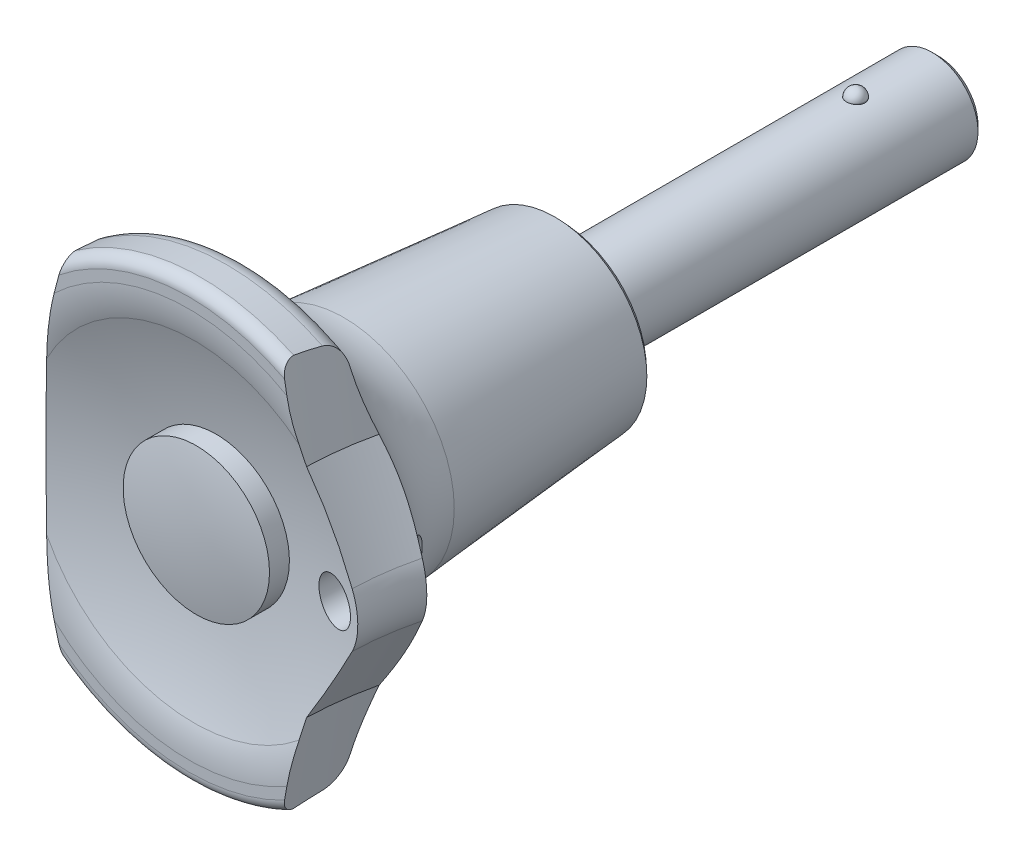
ISO-10303-21;
HEADER;
FILE_DESCRIPTION(('STEP AP214'),'2;1');
FILE_NAME('part.step','',(''),(''),'','','');
FILE_SCHEMA(('AUTOMOTIVE_DESIGN { 1 0 10303 214 1 1 1 1 }'));
ENDSEC;
DATA;
#1=APPLICATION_CONTEXT('core data for automotive mechanical design processes');
#2=APPLICATION_PROTOCOL_DEFINITION('international standard','automotive_design',2000,#1);
#3=PRODUCT_CONTEXT('',#1,'mechanical');
#4=PRODUCT('Part','Part','',(#3));
#5=PRODUCT_RELATED_PRODUCT_CATEGORY('part','',(#4));
#6=PRODUCT_DEFINITION_FORMATION('','',#4);
#7=PRODUCT_DEFINITION_CONTEXT('part definition',#1,'design');
#8=PRODUCT_DEFINITION('design','',#6,#7);
#9=PRODUCT_DEFINITION_SHAPE('','',#8);
#10=(LENGTH_UNIT() NAMED_UNIT(*) SI_UNIT(.MILLI.,.METRE.));
#11=(NAMED_UNIT(*) PLANE_ANGLE_UNIT() SI_UNIT($,.RADIAN.));
#12=(NAMED_UNIT(*) SI_UNIT($,.STERADIAN.) SOLID_ANGLE_UNIT());
#13=UNCERTAINTY_MEASURE_WITH_UNIT(LENGTH_MEASURE(1.E-05),#10,'distance_accuracy_value','');
#14=(GEOMETRIC_REPRESENTATION_CONTEXT(3) GLOBAL_UNCERTAINTY_ASSIGNED_CONTEXT((#13)) GLOBAL_UNIT_ASSIGNED_CONTEXT((#10,
#11,#12)) REPRESENTATION_CONTEXT('',''));
#15=CARTESIAN_POINT('',(0.,0.,0.));
#16=DIRECTION('',(0.,0.,1.));
#17=DIRECTION('',(1.,0.,0.));
#18=AXIS2_PLACEMENT_3D('',#15,#16,#17);
#19=CARTESIAN_POINT('',(0.,3.94833333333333,-25.8));
#20=DIRECTION('',(1.,0.,0.));
#21=DIRECTION('',(0.,1.,0.));
#22=AXIS2_PLACEMENT_3D('',#19,#20,#21);
#23=SPHERICAL_SURFACE('',#22,0.801666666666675);
#24=CARTESIAN_POINT('',(0.,3.99999999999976,-25.8000000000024));
#25=DIRECTION('',(0.,1.,-5.97983654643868E-13));
#26=DIRECTION('',(0.,5.97983654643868E-13,1.));
#27=AXIS2_PLACEMENT_3D('',#24,#25,#26);
#28=CIRCLE('',#27,0.8);
#29=CARTESIAN_POINT('',(0.,4.00000000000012,-25.0000000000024));
#30=VERTEX_POINT('',#29);
#31=CARTESIAN_POINT('',(0.,4.00000000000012,-26.6000000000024));
#32=VERTEX_POINT('',#31);
#33=EDGE_CURVE('E597',#30,#32,#28,.F.);
#34=ORIENTED_EDGE('',*,*,#33,.F.);
#35=CARTESIAN_POINT('',(0.,4.00000000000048,-25.8000000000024));
#36=DIRECTION('',(0.,1.,-5.97983654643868E-13));
#37=DIRECTION('',(0.,5.97983654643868E-13,1.));
#38=AXIS2_PLACEMENT_3D('',#35,#36,#37);
#39=CIRCLE('',#38,0.8);
#40=EDGE_CURVE('E594',#32,#30,#39,.F.);
#41=ORIENTED_EDGE('',*,*,#40,.F.);
#42=EDGE_LOOP('',(#34,#41));
#43=FACE_BOUND('',#42,.T.);
#44=ADVANCED_FACE('F14',(#43),#23,.T.);
#45=CARTESIAN_POINT('',(0.,-3.94833333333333,-25.8));
#46=DIRECTION('',(1.,0.,0.));
#47=DIRECTION('',(0.,1.,0.));
#48=AXIS2_PLACEMENT_3D('',#45,#46,#47);
#49=SPHERICAL_SURFACE('',#48,0.801666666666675);
#50=CARTESIAN_POINT('',(0.,-3.99999999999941,-25.7999999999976));
#51=DIRECTION('',(0.,1.,-5.97983654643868E-13));
#52=DIRECTION('',(0.,5.97983654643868E-13,1.));
#53=AXIS2_PLACEMENT_3D('',#50,#51,#52);
#54=CIRCLE('',#53,0.8);
#55=CARTESIAN_POINT('',(0.,-3.99999999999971,-26.5999999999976));
#56=VERTEX_POINT('',#55);
#57=CARTESIAN_POINT('',(0.,-3.99999999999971,-24.9999999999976));
#58=VERTEX_POINT('',#57);
#59=EDGE_CURVE('E29',#56,#58,#54,.T.);
#60=ORIENTED_EDGE('',*,*,#59,.F.);
#61=CARTESIAN_POINT('',(0.,-3.99999999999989,-25.7999999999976));
#62=DIRECTION('',(0.,1.,-5.97983654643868E-13));
#63=DIRECTION('',(0.,5.97983654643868E-13,1.));
#64=AXIS2_PLACEMENT_3D('',#61,#62,#63);
#65=CIRCLE('',#64,0.8);
#66=EDGE_CURVE('E586',#58,#56,#65,.T.);
#67=ORIENTED_EDGE('',*,*,#66,.F.);
#68=EDGE_LOOP('',(#60,#67));
#69=FACE_BOUND('',#68,.T.);
#70=ADVANCED_FACE('F565',(#69),#49,.T.);
#71=CARTESIAN_POINT('',(0.,0.,-25.8));
#72=DIRECTION('',(0.,1.,-5.97983654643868E-13));
#73=DIRECTION('',(0.,5.97983654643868E-13,1.));
#74=AXIS2_PLACEMENT_3D('',#71,#72,#73);
#75=CYLINDRICAL_SURFACE('',#74,0.8);
#76=CARTESIAN_POINT('',(0.,-4.00000000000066,-26.5999999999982));
#77=CARTESIAN_POINT('',(-0.0445375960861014,-4.0000279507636,-26.6000403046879));
#78=CARTESIAN_POINT('',(-0.089054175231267,-3.99925700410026,-26.5962833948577));
#79=CARTESIAN_POINT('',(-0.176745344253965,-3.99632620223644,-26.5814842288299));
#80=CARTESIAN_POINT('',(-0.2199218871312,-3.99416847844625,-26.5704531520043));
#81=CARTESIAN_POINT('',(-0.303782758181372,-3.98867145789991,-26.5414110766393));
#82=CARTESIAN_POINT('',(-0.344466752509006,-3.98533200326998,-26.5233991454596));
#83=CARTESIAN_POINT('',(-0.422240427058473,-3.97784324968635,-26.4809370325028));
#84=CARTESIAN_POINT('',(-0.459329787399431,-3.97369387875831,-26.4564862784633));
#85=CARTESIAN_POINT('',(-0.529353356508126,-3.96497766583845,-26.4014906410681));
#86=CARTESIAN_POINT('',(-0.562232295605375,-3.96040640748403,-26.370876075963));
#87=CARTESIAN_POINT('',(-0.622426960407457,-3.95139379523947,-26.3045691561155));
#88=CARTESIAN_POINT('',(-0.649741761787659,-3.94695246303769,-26.2688759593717));
#89=CARTESIAN_POINT('',(-0.698266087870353,-3.93865943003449,-26.1930260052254));
#90=CARTESIAN_POINT('',(-0.719417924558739,-3.93481344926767,-26.1528316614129));
#91=CARTESIAN_POINT('',(-0.754645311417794,-3.92820998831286,-26.0693721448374));
#92=CARTESIAN_POINT('',(-0.768721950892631,-3.92545234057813,-26.0261074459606));
#93=CARTESIAN_POINT('',(-0.789220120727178,-3.92138246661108,-25.9383330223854));
#94=CARTESIAN_POINT('',(-0.795739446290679,-3.92005179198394,-25.8938470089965));
#95=CARTESIAN_POINT('',(-0.801241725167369,-3.91893099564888,-25.8043931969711));
#96=CARTESIAN_POINT('',(-0.800225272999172,-3.91914075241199,-25.7594254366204));
#97=CARTESIAN_POINT('',(-0.790763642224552,-3.92106041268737,-25.6710024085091));
#98=CARTESIAN_POINT('',(-0.782430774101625,-3.92274763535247,-25.6275345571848));
#99=CARTESIAN_POINT('',(-0.758750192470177,-3.92739639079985,-25.54262683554));
#100=CARTESIAN_POINT('',(-0.743402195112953,-3.93035797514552,-25.5011870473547));
#101=CARTESIAN_POINT('',(-0.706019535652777,-3.93724500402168,-25.4211871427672));
#102=CARTESIAN_POINT('',(-0.683940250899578,-3.94117684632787,-25.382648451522));
#103=CARTESIAN_POINT('',(-0.633753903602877,-3.94955709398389,-25.3097822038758));
#104=CARTESIAN_POINT('',(-0.605646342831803,-3.95400554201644,-25.2754549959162));
#105=CARTESIAN_POINT('',(-0.54360415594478,-3.96301558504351,-25.2113406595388));
#106=CARTESIAN_POINT('',(-0.509574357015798,-3.96757778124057,-25.1816456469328));
#107=CARTESIAN_POINT('',(-0.436957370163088,-3.9762297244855,-25.1283630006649));
#108=CARTESIAN_POINT('',(-0.398368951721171,-3.98031934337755,-25.1047770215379));
#109=CARTESIAN_POINT('',(-0.317622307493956,-3.987576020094,-25.0643643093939));
#110=CARTESIAN_POINT('',(-0.27545671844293,-3.99074111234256,-25.0475519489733));
#111=CARTESIAN_POINT('',(-0.188849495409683,-3.99577375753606,-25.0212982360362));
#112=CARTESIAN_POINT('',(-0.14441132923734,-3.99764322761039,-25.0118459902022));
#113=CARTESIAN_POINT('',(-0.0830150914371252,-3.99917303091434,-25.0041437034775));
#114=CARTESIAN_POINT('',(-0.0664370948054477,-3.99948283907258,-25.0025892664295));
#115=CARTESIAN_POINT('',(-0.0332418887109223,-3.99989614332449,-25.0005187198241));
#116=CARTESIAN_POINT('',(-0.0166247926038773,-3.99999998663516,-25.0000008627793));
#117=CARTESIAN_POINT('',(0.,-4.,-24.9999999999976));
#118=B_SPLINE_CURVE_WITH_KNOTS('',3,(#76,#77,#78,#79,#80,#81,#82,#83,#84,#85,#86,#87,#88,#89,
#90,#91,#92,#93,#94,#95,#96,#97,#98,#99,#100,#101,#102,#103,#104,#105,#106,#107,#108,#109,#110,
#111,#112,#113,#114,#115,#116,#117),.UNSPECIFIED.,.F.,.F.,(4,2,2,2,2,2,2,2,2,2,2,2,2,2,2,2,2,2,
2,2,4),(0.,0.133416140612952,0.266627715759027,0.399857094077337,0.533098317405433,
0.667940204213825,0.802804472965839,0.938893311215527,1.07496119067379,1.20924790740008,
1.34352402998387,1.47577429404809,1.60802990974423,1.74118206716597,1.87434523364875,
2.00988854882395,2.14546853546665,2.2813347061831,2.41699940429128,2.46693430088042,
2.5167849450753),.UNSPECIFIED.);
#119=EDGE_CURVE('E577',#56,#58,#118,.T.);
#120=ORIENTED_EDGE('',*,*,#119,.F.);
#121=ORIENTED_EDGE('',*,*,#59,.T.);
#122=EDGE_LOOP('',(#120,#121));
#123=FACE_BOUND('',#122,.T.);
#124=ADVANCED_FACE('F568',(#123),#75,.T.);
#125=CARTESIAN_POINT('',(0.,0.,-25.8));
#126=DIRECTION('',(0.,1.,-5.97983654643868E-13));
#127=DIRECTION('',(0.,5.97983654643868E-13,1.));
#128=AXIS2_PLACEMENT_3D('',#125,#126,#127);
#129=CYLINDRICAL_SURFACE('',#128,0.8);
#130=CARTESIAN_POINT('',(0.,4.,-25.0000000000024));
#131=CARTESIAN_POINT('',(-0.0445375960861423,4.00002795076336,-24.9999596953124));
#132=CARTESIAN_POINT('',(-0.0890541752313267,3.9992570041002,-25.0037166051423));
#133=CARTESIAN_POINT('',(-0.176745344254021,3.9963262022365,-25.01851577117));
#134=CARTESIAN_POINT('',(-0.219921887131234,3.99416847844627,-25.0295468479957));
#135=CARTESIAN_POINT('',(-0.30378275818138,3.98867145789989,-25.0585889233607));
#136=CARTESIAN_POINT('',(-0.34446675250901,3.98533200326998,-25.0766008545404));
#137=CARTESIAN_POINT('',(-0.422240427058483,3.97784324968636,-25.1190629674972));
#138=CARTESIAN_POINT('',(-0.45932978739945,3.97369387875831,-25.1435137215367));
#139=CARTESIAN_POINT('',(-0.529353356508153,3.96497766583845,-25.1985093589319));
#140=CARTESIAN_POINT('',(-0.562232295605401,3.96040640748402,-25.229123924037));
#141=CARTESIAN_POINT('',(-0.622426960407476,3.95139379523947,-25.2954308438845));
#142=CARTESIAN_POINT('',(-0.649741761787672,3.94695246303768,-25.3311240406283));
#143=CARTESIAN_POINT('',(-0.698266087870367,3.93865943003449,-25.4069739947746));
#144=CARTESIAN_POINT('',(-0.71941792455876,3.93481344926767,-25.4471683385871));
#145=CARTESIAN_POINT('',(-0.754645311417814,3.92820998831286,-25.5306278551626));
#146=CARTESIAN_POINT('',(-0.768721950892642,3.92545234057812,-25.5738925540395));
#147=CARTESIAN_POINT('',(-0.789220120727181,3.92138246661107,-25.6616669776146));
#148=CARTESIAN_POINT('',(-0.795739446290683,3.92005179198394,-25.7061529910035));
#149=CARTESIAN_POINT('',(-0.801241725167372,3.91893099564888,-25.795606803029));
#150=CARTESIAN_POINT('',(-0.800225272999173,3.91914075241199,-25.8405745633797));
#151=CARTESIAN_POINT('',(-0.790763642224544,3.92106041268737,-25.928997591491));
#152=CARTESIAN_POINT('',(-0.782430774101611,3.92274763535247,-25.9724654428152));
#153=CARTESIAN_POINT('',(-0.758750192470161,3.92739639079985,-26.0573731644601));
#154=CARTESIAN_POINT('',(-0.743402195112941,3.93035797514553,-26.0988129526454));
#155=CARTESIAN_POINT('',(-0.706019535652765,3.93724500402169,-26.1788128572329));
#156=CARTESIAN_POINT('',(-0.683940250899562,3.94117684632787,-26.2173515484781));
#157=CARTESIAN_POINT('',(-0.633753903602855,3.94955709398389,-26.2902177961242));
#158=CARTESIAN_POINT('',(-0.605646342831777,3.95400554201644,-26.3245450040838));
#159=CARTESIAN_POINT('',(-0.543604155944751,3.96301558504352,-26.3886593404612));
#160=CARTESIAN_POINT('',(-0.509574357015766,3.96757778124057,-26.4183543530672));
#161=CARTESIAN_POINT('',(-0.43695737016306,3.97622972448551,-26.4716369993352));
#162=CARTESIAN_POINT('',(-0.398368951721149,3.98031934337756,-26.4952229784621));
#163=CARTESIAN_POINT('',(-0.317622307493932,3.98757602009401,-26.5356356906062));
#164=CARTESIAN_POINT('',(-0.275456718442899,3.99074111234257,-26.5524480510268));
#165=CARTESIAN_POINT('',(-0.188849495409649,3.99577375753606,-26.5787017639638));
#166=CARTESIAN_POINT('',(-0.144411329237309,3.99764322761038,-26.5881540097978));
#167=CARTESIAN_POINT('',(-0.0830150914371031,3.99917303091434,-26.5958562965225));
#168=CARTESIAN_POINT('',(-0.0664370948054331,3.99948283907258,-26.5974107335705));
#169=CARTESIAN_POINT('',(-0.0332418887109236,3.99989614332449,-26.5994812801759));
#170=CARTESIAN_POINT('',(-0.016624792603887,3.99999998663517,-26.5999991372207));
#171=CARTESIAN_POINT('',(0.,4.,-26.6000000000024));
#172=B_SPLINE_CURVE_WITH_KNOTS('',3,(#130,#131,#132,#133,#134,#135,#136,#137,#138,#139,#140,
#141,#142,#143,#144,#145,#146,#147,#148,#149,#150,#151,#152,#153,#154,#155,#156,#157,#158,#159,
#160,#161,#162,#163,#164,#165,#166,#167,#168,#169,#170,#171),.UNSPECIFIED.,.F.,.F.,(4,2,2,2,2,2,
2,2,2,2,2,2,2,2,2,2,2,2,2,2,4),(0.,0.133416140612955,0.266627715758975,0.399857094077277,
0.533098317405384,0.667940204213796,0.802804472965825,0.938893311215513,1.07496119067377,
1.20924790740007,1.34352402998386,1.47577429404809,1.60802990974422,1.74118206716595,
1.8743452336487,2.00988854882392,2.14546853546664,2.28133470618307,2.41699940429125,
2.46693430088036,2.51678494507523),.UNSPECIFIED.);
#173=EDGE_CURVE('E585',#30,#32,#172,.T.);
#174=ORIENTED_EDGE('',*,*,#173,.F.);
#175=ORIENTED_EDGE('',*,*,#33,.T.);
#176=EDGE_LOOP('',(#174,#175));
#177=FACE_BOUND('',#176,.T.);
#178=ADVANCED_FACE('F572',(#177),#129,.T.);
#179=CARTESIAN_POINT('',(0.,1.75,-33.));
#180=DIRECTION('',(0.,0.,-1.));
#181=DIRECTION('',(-1.,0.,0.));
#182=AXIS2_PLACEMENT_3D('',#179,#180,#181);
#183=PLANE('',#182);
#184=CARTESIAN_POINT('',(0.,0.,-33.0000000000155));
#185=DIRECTION('',(0.,0.,1.));
#186=DIRECTION('',(1.,0.,0.));
#187=AXIS2_PLACEMENT_3D('',#184,#185,#186);
#188=CIRCLE('',#187,3.49999999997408);
#189=CARTESIAN_POINT('',(3.49999999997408,0.,-33.0000000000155));
#190=VERTEX_POINT('',#189);
#191=EDGE_CURVE('E609',#190,#190,#188,.T.);
#192=ORIENTED_EDGE('',*,*,#191,.F.);
#193=EDGE_LOOP('',(#192));
#194=FACE_BOUND('',#193,.T.);
#195=ADVANCED_FACE('F646',(#194),#183,.T.);
#196=CARTESIAN_POINT('',(0.,0.,-25.8));
#197=DIRECTION('',(0.,1.,-5.97983654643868E-13));
#198=DIRECTION('',(0.,5.97983654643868E-13,1.));
#199=AXIS2_PLACEMENT_3D('',#196,#197,#198);
#200=CYLINDRICAL_SURFACE('',#199,0.8);
#201=CARTESIAN_POINT('',(0.,4.00000000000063,-26.6000000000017));
#202=CARTESIAN_POINT('',(0.0445375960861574,4.00002795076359,-26.6000403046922));
#203=CARTESIAN_POINT('',(0.0890541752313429,3.99925700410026,-26.5962833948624));
#204=CARTESIAN_POINT('',(0.176745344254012,3.99632620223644,-26.5814842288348));
#205=CARTESIAN_POINT('',(0.219921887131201,3.99416847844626,-26.5704531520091));
#206=CARTESIAN_POINT('',(0.303782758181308,3.98867145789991,-26.5414110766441));
#207=CARTESIAN_POINT('',(0.344466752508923,3.98533200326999,-26.5233991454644));
#208=CARTESIAN_POINT('',(0.422240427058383,3.97784324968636,-26.4809370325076));
#209=CARTESIAN_POINT('',(0.45932978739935,3.97369387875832,-26.4564862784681));
#210=CARTESIAN_POINT('',(0.529353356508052,3.96497766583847,-26.4014906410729));
#211=CARTESIAN_POINT('',(0.562232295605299,3.96040640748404,-26.3708760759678));
#212=CARTESIAN_POINT('',(0.622426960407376,3.95139379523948,-26.3045691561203));
#213=CARTESIAN_POINT('',(0.649741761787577,3.9469524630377,-26.2688759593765));
#214=CARTESIAN_POINT('',(0.698266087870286,3.9386594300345,-26.1930260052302));
#215=CARTESIAN_POINT('',(0.719417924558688,3.93481344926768,-26.1528316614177));
#216=CARTESIAN_POINT('',(0.754645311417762,3.92820998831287,-26.0693721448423));
#217=CARTESIAN_POINT('',(0.768721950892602,3.92545234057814,-26.0261074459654));
#218=CARTESIAN_POINT('',(0.789220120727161,3.92138246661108,-25.9383330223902));
#219=CARTESIAN_POINT('',(0.79573944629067,3.92005179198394,-25.8938470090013));
#220=CARTESIAN_POINT('',(0.801241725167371,3.91893099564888,-25.8043931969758));
#221=CARTESIAN_POINT('',(0.800225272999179,3.91914075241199,-25.7594254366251));
#222=CARTESIAN_POINT('',(0.790763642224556,3.92106041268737,-25.6710024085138));
#223=CARTESIAN_POINT('',(0.782430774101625,3.92274763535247,-25.6275345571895));
#224=CARTESIAN_POINT('',(0.758750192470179,3.92739639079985,-25.5426268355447));
#225=CARTESIAN_POINT('',(0.743402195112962,3.93035797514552,-25.5011870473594));
#226=CARTESIAN_POINT('',(0.706019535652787,3.93724500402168,-25.4211871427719));
#227=CARTESIAN_POINT('',(0.683940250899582,3.94117684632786,-25.3826484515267));
#228=CARTESIAN_POINT('',(0.633753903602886,3.94955709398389,-25.3097822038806));
#229=CARTESIAN_POINT('',(0.605646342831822,3.95400554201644,-25.2754549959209));
#230=CARTESIAN_POINT('',(0.543604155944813,3.96301558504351,-25.2113406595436));
#231=CARTESIAN_POINT('',(0.509574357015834,3.96757778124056,-25.1816456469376));
#232=CARTESIAN_POINT('',(0.436957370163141,3.9762297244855,-25.1283630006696));
#233=CARTESIAN_POINT('',(0.398368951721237,3.98031934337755,-25.1047770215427));
#234=CARTESIAN_POINT('',(0.317622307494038,3.987576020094,-25.0643643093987));
#235=CARTESIAN_POINT('',(0.275456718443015,3.99074111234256,-25.0475519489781));
#236=CARTESIAN_POINT('',(0.188849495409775,3.99577375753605,-25.021298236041));
#237=CARTESIAN_POINT('',(0.144411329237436,3.99764322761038,-25.011845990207));
#238=CARTESIAN_POINT('',(0.0830150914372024,3.99917303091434,-25.0041437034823));
#239=CARTESIAN_POINT('',(0.0664370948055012,3.99948283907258,-25.0025892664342));
#240=CARTESIAN_POINT('',(0.0332418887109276,3.99989614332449,-25.0005187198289));
#241=CARTESIAN_POINT('',(0.0166247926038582,3.99999998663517,-25.0000008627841));
#242=CARTESIAN_POINT('',(0.,4.,-25.0000000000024));
#243=B_SPLINE_CURVE_WITH_KNOTS('',3,(#201,#202,#203,#204,#205,#206,#207,#208,#209,#210,#211,
#212,#213,#214,#215,#216,#217,#218,#219,#220,#221,#222,#223,#224,#225,#226,#227,#228,#229,#230,
#231,#232,#233,#234,#235,#236,#237,#238,#239,#240,#241,#242),.UNSPECIFIED.,.F.,.F.,(4,2,2,2,2,2,
2,2,2,2,2,2,2,2,2,2,2,2,2,2,4),(0.,0.133416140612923,0.266627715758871,0.399857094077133,
0.533098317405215,0.667940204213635,0.802804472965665,0.938893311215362,1.07496119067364,
1.20924790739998,1.34352402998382,1.47577429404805,1.60802990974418,1.7411820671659,
1.87434523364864,2.00988854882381,2.14546853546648,2.28133470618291,2.41699940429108,
2.46693430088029,2.51678494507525),.UNSPECIFIED.);
#244=EDGE_CURVE('E606',#32,#30,#243,.T.);
#245=ORIENTED_EDGE('',*,*,#244,.F.);
#246=ORIENTED_EDGE('',*,*,#40,.T.);
#247=EDGE_LOOP('',(#245,#246));
#248=FACE_BOUND('',#247,.T.);
#249=ADVANCED_FACE('F624',(#248),#200,.T.);
#250=CARTESIAN_POINT('',(0.,0.,-25.8));
#251=DIRECTION('',(0.,1.,-5.97983654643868E-13));
#252=DIRECTION('',(0.,5.97983654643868E-13,1.));
#253=AXIS2_PLACEMENT_3D('',#250,#251,#252);
#254=CYLINDRICAL_SURFACE('',#253,0.8);
#255=CARTESIAN_POINT('',(0.,-4.00000000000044,-24.9999999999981));
#256=CARTESIAN_POINT('',(0.0445375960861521,-4.00002795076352,-24.9999596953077));
#257=CARTESIAN_POINT('',(0.0890541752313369,-3.99925700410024,-25.0037166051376));
#258=CARTESIAN_POINT('',(0.176745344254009,-3.99632620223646,-25.0185157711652));
#259=CARTESIAN_POINT('',(0.219921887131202,-3.99416847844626,-25.0295468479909));
#260=CARTESIAN_POINT('',(0.303782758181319,-3.98867145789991,-25.0585889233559));
#261=CARTESIAN_POINT('',(0.344466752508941,-3.98533200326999,-25.0766008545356));
#262=CARTESIAN_POINT('',(0.422240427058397,-3.97784324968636,-25.1190629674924));
#263=CARTESIAN_POINT('',(0.459329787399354,-3.97369387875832,-25.1435137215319));
#264=CARTESIAN_POINT('',(0.529353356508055,-3.96497766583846,-25.1985093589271));
#265=CARTESIAN_POINT('',(0.562232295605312,-3.96040640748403,-25.2291239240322));
#266=CARTESIAN_POINT('',(0.622426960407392,-3.95139379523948,-25.2954308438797));
#267=CARTESIAN_POINT('',(0.649741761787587,-3.9469524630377,-25.3311240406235));
#268=CARTESIAN_POINT('',(0.698266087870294,-3.9386594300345,-25.4069739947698));
#269=CARTESIAN_POINT('',(0.719417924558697,-3.93481344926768,-25.4471683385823));
#270=CARTESIAN_POINT('',(0.754645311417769,-3.92820998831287,-25.5306278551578));
#271=CARTESIAN_POINT('',(0.768721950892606,-3.92545234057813,-25.5738925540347));
#272=CARTESIAN_POINT('',(0.789220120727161,-3.92138246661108,-25.6616669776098));
#273=CARTESIAN_POINT('',(0.795739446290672,-3.92005179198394,-25.7061529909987));
#274=CARTESIAN_POINT('',(0.801241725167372,-3.91893099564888,-25.7956068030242));
#275=CARTESIAN_POINT('',(0.800225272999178,-3.91914075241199,-25.8405745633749));
#276=CARTESIAN_POINT('',(0.790763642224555,-3.92106041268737,-25.9289975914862));
#277=CARTESIAN_POINT('',(0.782430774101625,-3.92274763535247,-25.9724654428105));
#278=CARTESIAN_POINT('',(0.758750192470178,-3.92739639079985,-26.0573731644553));
#279=CARTESIAN_POINT('',(0.743402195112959,-3.93035797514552,-26.0988129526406));
#280=CARTESIAN_POINT('',(0.706019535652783,-3.93724500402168,-26.1788128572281));
#281=CARTESIAN_POINT('',(0.683940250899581,-3.94117684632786,-26.2173515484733));
#282=CARTESIAN_POINT('',(0.633753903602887,-3.94955709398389,-26.2902177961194));
#283=CARTESIAN_POINT('',(0.605646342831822,-3.95400554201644,-26.3245450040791));
#284=CARTESIAN_POINT('',(0.543604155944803,-3.96301558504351,-26.3886593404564));
#285=CARTESIAN_POINT('',(0.509574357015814,-3.96757778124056,-26.4183543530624));
#286=CARTESIAN_POINT('',(0.436957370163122,-3.9762297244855,-26.4716369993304));
#287=CARTESIAN_POINT('',(0.398368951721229,-3.98031934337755,-26.4952229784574));
#288=CARTESIAN_POINT('',(0.317622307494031,-3.987576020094,-26.5356356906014));
#289=CARTESIAN_POINT('',(0.275456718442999,-3.99074111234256,-26.552448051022));
#290=CARTESIAN_POINT('',(0.188849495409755,-3.99577375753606,-26.578701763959));
#291=CARTESIAN_POINT('',(0.144411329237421,-3.99764322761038,-26.588154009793));
#292=CARTESIAN_POINT('',(0.0830150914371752,-3.99917303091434,-26.5958562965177));
#293=CARTESIAN_POINT('',(0.0664370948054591,-3.99948283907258,-26.5974107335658));
#294=CARTESIAN_POINT('',(0.0332418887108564,-3.9998961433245,-26.5994812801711));
#295=CARTESIAN_POINT('',(0.0166247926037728,-3.99999998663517,-26.5999991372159));
#296=CARTESIAN_POINT('',(0.,-4.,-26.5999999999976));
#297=B_SPLINE_CURVE_WITH_KNOTS('',3,(#255,#256,#257,#258,#259,#260,#261,#262,#263,#264,#265,
#266,#267,#268,#269,#270,#271,#272,#273,#274,#275,#276,#277,#278,#279,#280,#281,#282,#283,#284,
#285,#286,#287,#288,#289,#290,#291,#292,#293,#294,#295,#296),.UNSPECIFIED.,.F.,.F.,(4,2,2,2,2,2,
2,2,2,2,2,2,2,2,2,2,2,2,2,2,4),(0.,0.133416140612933,0.26662771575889,0.399857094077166,
0.533098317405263,0.667940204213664,0.802804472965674,0.938893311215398,1.07496119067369,
1.20924790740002,1.34352402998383,1.47577429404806,1.60802990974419,1.7411820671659,
1.87434523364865,2.00988854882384,2.14546853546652,2.28133470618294,2.4169994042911,
2.46693430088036,2.51678494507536),.UNSPECIFIED.);
#298=EDGE_CURVE('E603',#58,#56,#297,.T.);
#299=ORIENTED_EDGE('',*,*,#298,.F.);
#300=ORIENTED_EDGE('',*,*,#66,.T.);
#301=EDGE_LOOP('',(#299,#300));
#302=FACE_BOUND('',#301,.T.);
#303=ADVANCED_FACE('F605',(#302),#254,.T.);
#304=CARTESIAN_POINT('',(0.,0.,-32.5000000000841));
#305=DIRECTION('',(0.,0.,1.));
#306=DIRECTION('',(1.,0.,0.));
#307=AXIS2_PLACEMENT_3D('',#304,#305,#306);
#308=CONICAL_SURFACE('',#307,3.99999999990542,0.785398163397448);
#309=ORIENTED_EDGE('',*,*,#191,.T.);
#310=EDGE_LOOP('',(#309));
#311=FACE_BOUND('',#310,.T.);
#312=CARTESIAN_POINT('',(0.,0.,-32.5));
#313=DIRECTION('',(0.,0.,1.));
#314=DIRECTION('',(1.,0.,0.));
#315=AXIS2_PLACEMENT_3D('',#312,#313,#314);
#316=CIRCLE('',#315,4.);
#317=CARTESIAN_POINT('',(4.,0.,-32.5));
#318=VERTEX_POINT('',#317);
#319=EDGE_CURVE('E24',#318,#318,#316,.T.);
#320=ORIENTED_EDGE('',*,*,#319,.F.);
#321=EDGE_LOOP('',(#320));
#322=FACE_BOUND('',#321,.T.);
#323=ADVANCED_FACE('F623',(#311,#322),#308,.T.);
#324=CARTESIAN_POINT('',(0.,0.,-8.125));
#325=DIRECTION('',(0.,0.,1.));
#326=DIRECTION('',(1.,0.,0.));
#327=AXIS2_PLACEMENT_3D('',#324,#325,#326);
#328=CYLINDRICAL_SURFACE('',#327,4.);
#329=CARTESIAN_POINT('',(0.,0.,0.));
#330=DIRECTION('',(0.,0.,-1.));
#331=DIRECTION('',(-1.,0.,0.));
#332=AXIS2_PLACEMENT_3D('',#329,#330,#331);
#333=CIRCLE('',#332,4.);
#334=CARTESIAN_POINT('',(-4.,0.,0.));
#335=VERTEX_POINT('',#334);
#336=EDGE_CURVE('E9',#335,#335,#333,.F.);
#337=ORIENTED_EDGE('',*,*,#336,.F.);
#338=EDGE_LOOP('',(#337));
#339=FACE_BOUND('',#338,.T.);
#340=ORIENTED_EDGE('',*,*,#173,.T.);
#341=ORIENTED_EDGE('',*,*,#244,.T.);
#342=EDGE_LOOP('',(#340,#341));
#343=FACE_BOUND('',#342,.T.);
#344=ORIENTED_EDGE('',*,*,#119,.T.);
#345=ORIENTED_EDGE('',*,*,#298,.T.);
#346=EDGE_LOOP('',(#344,#345));
#347=FACE_BOUND('',#346,.T.);
#348=ORIENTED_EDGE('',*,*,#319,.T.);
#349=EDGE_LOOP('',(#348));
#350=FACE_BOUND('',#349,.T.);
#351=ADVANCED_FACE('F16',(#339,#343,#347,#350),#328,.T.);
#352=CARTESIAN_POINT('',(0.,1.03504969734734E-13,0.667307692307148));
#353=DIRECTION('',(1.,0.,0.));
#354=DIRECTION('',(0.,1.,0.));
#355=AXIS2_PLACEMENT_3D('',#352,#353,#354);
#356=SPHERICAL_SURFACE('',#355,31.8326923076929);
#357=CARTESIAN_POINT('',(0.,0.,31.85));
#358=DIRECTION('',(0.,0.,1.));
#359=DIRECTION('',(1.,0.,0.));
#360=AXIS2_PLACEMENT_3D('',#357,#358,#359);
#361=CIRCLE('',#360,6.4);
#362=CARTESIAN_POINT('',(6.4,0.,31.85));
#363=VERTEX_POINT('',#362);
#364=EDGE_CURVE('E536',#363,#363,#361,.F.);
#365=ORIENTED_EDGE('',*,*,#364,.F.);
#366=EDGE_LOOP('',(#365));
#367=FACE_BOUND('',#366,.T.);
#368=ADVANCED_FACE('F541',(#367),#356,.T.);
#369=CARTESIAN_POINT('',(0.,0.,24.05));
#370=DIRECTION('',(0.,0.,1.));
#371=DIRECTION('',(1.,0.,0.));
#372=AXIS2_PLACEMENT_3D('',#369,#370,#371);
#373=CYLINDRICAL_SURFACE('',#372,6.4);
#374=ORIENTED_EDGE('',*,*,#364,.T.);
#375=EDGE_LOOP('',(#374));
#376=FACE_BOUND('',#375,.T.);
#377=CARTESIAN_POINT('',(6.4,0.,30.1110590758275));
#378=CARTESIAN_POINT('',(6.40000129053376,-0.179810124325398,30.111059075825));
#379=CARTESIAN_POINT('',(6.39241914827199,-0.359599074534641,30.1110590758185));
#380=CARTESIAN_POINT('',(6.3621435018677,-0.71795909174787,30.1110590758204));
#381=CARTESIAN_POINT('',(6.33944602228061,-0.896529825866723,30.1110590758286));
#382=CARTESIAN_POINT('',(6.2790684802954,-1.25128110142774,30.1110590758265));
#383=CARTESIAN_POINT('',(6.24137507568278,-1.42745936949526,30.1110590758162));
#384=CARTESIAN_POINT('',(6.15125799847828,-1.77607703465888,30.1110590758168));
#385=CARTESIAN_POINT('',(6.09882894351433,-1.94851504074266,30.1110590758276));
#386=CARTESIAN_POINT('',(5.9796699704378,-2.2882129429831,30.1110590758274));
#387=CARTESIAN_POINT('',(5.91295217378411,-2.45547709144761,30.1110590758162));
#388=CARTESIAN_POINT('',(5.76563661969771,-2.7838514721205,30.1110590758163));
#389=CARTESIAN_POINT('',(5.68503375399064,-2.9449594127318,30.1110590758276));
#390=CARTESIAN_POINT('',(5.51059240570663,-3.25971260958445,30.1110590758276));
#391=CARTESIAN_POINT('',(5.4167621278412,-3.41336241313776,30.1110590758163));
#392=CARTESIAN_POINT('',(5.21645805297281,-3.71226938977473,30.1110590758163));
#393=CARTESIAN_POINT('',(5.10997960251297,-3.85752344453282,30.1110590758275));
#394=CARTESIAN_POINT('',(4.88519374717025,-4.13850742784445,30.1110590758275));
#395=CARTESIAN_POINT('',(4.76688947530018,-4.27423986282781,30.1110590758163));
#396=CARTESIAN_POINT('',(4.51922341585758,-4.53530651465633,30.1110590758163));
#397=CARTESIAN_POINT('',(4.38985756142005,-4.66063687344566,30.1110590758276));
#398=CARTESIAN_POINT('',(4.12107041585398,-4.89991253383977,30.1110590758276));
#399=CARTESIAN_POINT('',(3.98165245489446,-5.01386157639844,30.1110590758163));
#400=CARTESIAN_POINT('',(3.69366097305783,-5.22965167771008,30.1110590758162));
#401=CARTESIAN_POINT('',(3.54508409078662,-5.33148825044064,30.1110590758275));
#402=CARTESIAN_POINT('',(3.23993719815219,-5.52224318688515,30.1110590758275));
#403=CARTESIAN_POINT('',(3.08337030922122,-5.61116654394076,30.1110590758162));
#404=CARTESIAN_POINT('',(2.76324420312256,-5.77554056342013,30.1110590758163));
#405=CARTESIAN_POINT('',(2.59968242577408,-5.85098623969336,30.1110590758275));
#406=CARTESIAN_POINT('',(2.2668445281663,-5.98780235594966,30.1110590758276));
#407=CARTESIAN_POINT('',(2.0975705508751,-6.04917800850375,30.1110590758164));
#408=CARTESIAN_POINT('',(1.75439473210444,-6.15747441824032,30.1110590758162));
#409=CARTESIAN_POINT('',(1.58049120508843,-6.20438983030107,30.1110590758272));
#410=CARTESIAN_POINT('',(1.22940084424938,-6.283384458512,30.1110590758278));
#411=CARTESIAN_POINT('',(1.05221523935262,-6.31546911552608,30.1110590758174));
#412=CARTESIAN_POINT('',(0.695754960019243,-6.36461764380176,30.1110590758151));
#413=CARTESIAN_POINT('',(0.516479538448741,-6.38167596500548,30.1110590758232));
#414=CARTESIAN_POINT('',(-0.0224375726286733,-6.41003711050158,30.1110590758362));
#415=CARTESIAN_POINT('',(-0.383552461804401,-6.39861178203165,30.1110590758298));
#416=CARTESIAN_POINT('',(-1.09854136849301,-6.31529390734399,30.1110590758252));
#417=CARTESIAN_POINT('',(-1.45241538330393,-6.24340133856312,30.1110590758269));
#418=CARTESIAN_POINT('',(-2.14312422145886,-6.04122706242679,30.1110590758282));
#419=CARTESIAN_POINT('',(-2.47995902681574,-5.91094529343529,30.1110590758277));
#420=CARTESIAN_POINT('',(-3.12696102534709,-5.59568095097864,30.1110590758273));
#421=CARTESIAN_POINT('',(-3.43712822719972,-5.41069839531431,30.1110590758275));
#422=CARTESIAN_POINT('',(-4.02200801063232,-4.99128634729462,30.1110590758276));
#423=CARTESIAN_POINT('',(-4.29672060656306,-4.75685687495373,30.1110590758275));
#424=CARTESIAN_POINT('',(-4.80288833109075,-4.24520495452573,30.1110590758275));
#425=CARTESIAN_POINT('',(-5.03434345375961,-3.96798250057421,30.1110590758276));
#426=CARTESIAN_POINT('',(-5.4474271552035,-3.37861432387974,30.1110590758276));
#427=CARTESIAN_POINT('',(-5.62905572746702,-3.06646859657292,30.1110590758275));
#428=CARTESIAN_POINT('',(-5.9373300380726,-2.41611476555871,30.1110590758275));
#429=CARTESIAN_POINT('',(-6.06397577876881,-2.0779066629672,30.1110590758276));
#430=CARTESIAN_POINT('',(-6.25868942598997,-1.38502883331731,30.1110590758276));
#431=CARTESIAN_POINT('',(-6.32675733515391,-1.03035910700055,30.1110590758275));
#432=CARTESIAN_POINT('',(-6.40238305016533,-0.314626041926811,30.1110590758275));
#433=CARTESIAN_POINT('',(-6.4099408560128,0.0464372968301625,30.1110590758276));
#434=CARTESIAN_POINT('',(-6.36433185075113,0.764708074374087,30.1110590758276));
#435=CARTESIAN_POINT('',(-6.31116503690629,1.12191551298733,30.1110590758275));
#436=CARTESIAN_POINT('',(-6.14561593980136,1.82233442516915,30.1110590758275));
#437=CARTESIAN_POINT('',(-6.0332336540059,2.16554589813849,30.1110590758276));
#438=CARTESIAN_POINT('',(-5.75244417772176,2.82823003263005,30.1110590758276));
#439=CARTESIAN_POINT('',(-5.58403699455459,3.14770269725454,30.1110590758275));
#440=CARTESIAN_POINT('',(-5.19597704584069,3.75384041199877,30.1110590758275));
#441=CARTESIAN_POINT('',(-4.97632428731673,4.04050546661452,30.1110590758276));
#442=CARTESIAN_POINT('',(-4.49201316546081,4.57289025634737,30.1110590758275));
#443=CARTESIAN_POINT('',(-4.22735478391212,4.81860997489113,30.1110590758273));
#444=CARTESIAN_POINT('',(-3.66052736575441,5.26212983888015,30.1110590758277));
#445=CARTESIAN_POINT('',(-3.35835831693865,5.45992996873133,30.1110590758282));
#446=CARTESIAN_POINT('',(-2.72515445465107,5.80199137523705,30.111059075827));
#447=CARTESIAN_POINT('',(-2.39411967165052,5.94625270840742,30.1110590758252));
#448=CARTESIAN_POINT('',(-1.71233203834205,6.17715664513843,30.1110590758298));
#449=CARTESIAN_POINT('',(-1.3615791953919,6.26379927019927,30.1110590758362));
#450=CARTESIAN_POINT('',(-0.828635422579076,6.34869298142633,30.1110590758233));
#451=CARTESIAN_POINT('',(-0.649753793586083,6.36947821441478,30.1110590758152));
#452=CARTESIAN_POINT('',(-0.29089341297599,6.3959118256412,30.1110590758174));
#453=CARTESIAN_POINT('',(-0.110915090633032,6.40156578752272,30.1110590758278));
#454=CARTESIAN_POINT('',(0.248931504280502,6.39769010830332,30.1110590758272));
#455=CARTESIAN_POINT('',(0.42879971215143,6.38815488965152,30.1110590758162));
#456=CARTESIAN_POINT('',(0.787030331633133,6.35397041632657,30.1110590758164));
#457=CARTESIAN_POINT('',(0.965393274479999,6.32932674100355,30.1110590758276));
#458=CARTESIAN_POINT('',(1.31947460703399,6.2650918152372,30.1110590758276));
#459=CARTESIAN_POINT('',(1.49519199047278,6.22549501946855,30.1110590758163));
#460=CARTESIAN_POINT('',(1.84260157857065,6.13165408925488,30.1110590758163));
#461=CARTESIAN_POINT('',(2.01429524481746,6.07741536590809,30.1110590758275));
#462=CARTESIAN_POINT('',(2.35256975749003,5.95464555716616,30.1110590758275));
#463=CARTESIAN_POINT('',(2.51914859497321,5.88610893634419,30.1110590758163));
#464=CARTESIAN_POINT('',(2.84587864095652,5.73527147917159,30.1110590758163));
#465=CARTESIAN_POINT('',(3.00603219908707,5.65297573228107,30.1110590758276));
#466=CARTESIAN_POINT('',(3.31889024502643,5.47515780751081,30.1110590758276));
#467=CARTESIAN_POINT('',(3.47159225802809,5.37963127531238,30.1110590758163));
#468=CARTESIAN_POINT('',(3.76834973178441,5.17608944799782,30.1110590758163));
#469=CARTESIAN_POINT('',(3.91240836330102,5.06807877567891,30.1110590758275));
#470=CARTESIAN_POINT('',(4.19095341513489,4.84027769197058,30.1110590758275));
#471=CARTESIAN_POINT('',(4.32543729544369,4.72048417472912,30.1110590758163));
#472=CARTESIAN_POINT('',(4.58378691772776,4.47003941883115,30.1110590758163));
#473=CARTESIAN_POINT('',(4.70765655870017,4.33939220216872,30.1110590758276));
#474=CARTESIAN_POINT('',(4.94402627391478,4.0680460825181,30.1110590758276));
#475=CARTESIAN_POINT('',(5.05651927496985,3.92734101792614,30.1110590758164));
#476=CARTESIAN_POINT('',(5.26920889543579,3.63700546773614,30.1110590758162));
#477=CARTESIAN_POINT('',(5.36941003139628,3.48737829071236,30.1110590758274));
#478=CARTESIAN_POINT('',(5.55693134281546,3.18008480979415,30.1110590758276));
#479=CARTESIAN_POINT('',(5.6442405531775,3.02241181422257,30.1110590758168));
#480=CARTESIAN_POINT('',(5.80522542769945,2.70032605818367,30.1110590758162));
#481=CARTESIAN_POINT('',(5.87890606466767,2.53591578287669,30.1110590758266));
#482=CARTESIAN_POINT('',(6.01208998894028,2.20161657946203,30.1110590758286));
#483=CARTESIAN_POINT('',(6.07160584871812,2.03173266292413,30.1110590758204));
#484=CARTESIAN_POINT('',(6.17610679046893,1.68761339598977,30.1110590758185));
#485=CARTESIAN_POINT('',(6.22109569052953,1.51337920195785,30.111059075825));
#486=CARTESIAN_POINT('',(6.30560169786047,1.11794110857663,30.1110590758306));
#487=CARTESIAN_POINT('',(6.34097102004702,0.895838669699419,30.1110590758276));
#488=CARTESIAN_POINT('',(6.38816936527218,0.449146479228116,30.1110590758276));
#489=CARTESIAN_POINT('',(6.39999838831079,0.224556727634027,30.1110590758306));
#490=CARTESIAN_POINT('',(6.4,0.,30.1110590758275));
#491=B_SPLINE_CURVE_WITH_KNOTS('',3,(#377,#378,#379,#380,#381,#382,#383,#384,#385,#386,#387,
#388,#389,#390,#391,#392,#393,#394,#395,#396,#397,#398,#399,#400,#401,#402,#403,#404,#405,#406,
#407,#408,#409,#410,#411,#412,#413,#414,#415,#416,#417,#418,#419,#420,#421,#422,#423,#424,#425,
#426,#427,#428,#429,#430,#431,#432,#433,#434,#435,#436,#437,#438,#439,#440,#441,#442,#443,#444,
#445,#446,#447,#448,#449,#450,#451,#452,#453,#454,#455,#456,#457,#458,#459,#460,#461,#462,#463,
#464,#465,#466,#467,#468,#469,#470,#471,#472,#473,#474,#475,#476,#477,#478,#479,#480,#481,#482,
#483,#484,#485,#486,#487,#488,#489,#490),.UNSPECIFIED.,.T.,.F.,(4,2,2,2,2,2,2,2,2,2,2,2,2,2,2,2,
2,2,2,2,2,2,2,2,2,2,2,2,2,2,2,2,2,2,2,2,2,2,2,2,2,2,2,2,2,2,2,2,2,2,2,2,2,2,2,2,4),(0.,
0.539234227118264,1.07861033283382,1.61846741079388,2.15852193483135,2.69812012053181,
3.23791724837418,3.77738101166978,4.31704387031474,4.85656413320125,5.39628361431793,
5.93582510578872,6.47556580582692,7.01509723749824,7.55482786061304,8.09435820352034,
8.63408774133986,9.17361911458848,9.71334968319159,10.7916501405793,11.8699510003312,
12.9482529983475,14.0265546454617,15.1048558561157,16.1831572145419,17.2614587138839,
18.3397601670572,19.4180615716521,20.4963629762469,21.5746644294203,22.6529659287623,
23.7312672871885,24.8095684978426,25.8878701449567,26.966172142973,28.0444730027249,
29.1227734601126,29.6625040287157,30.2020354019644,30.7417649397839,31.2812952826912,
31.821025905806,32.3605573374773,32.9002980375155,33.4398395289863,33.979559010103,
34.5190792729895,35.0587421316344,35.59820589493,36.1380030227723,36.6776012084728,
37.2176557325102,37.7575128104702,38.2968889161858,38.836123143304,39.5095483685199,
40.1829735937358),.UNSPECIFIED.);
#492=CARTESIAN_POINT('',(6.4,0.,30.1110590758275));
#493=VERTEX_POINT('',#492);
#494=EDGE_CURVE('E550',#493,#493,#491,.T.);
#495=ORIENTED_EDGE('',*,*,#494,.F.);
#496=EDGE_LOOP('',(#495));
#497=FACE_BOUND('',#496,.T.);
#498=ADVANCED_FACE('F543',(#376,#497),#373,.T.);
#499=CARTESIAN_POINT('',(0.,0.,31.5));
#500=DIRECTION('',(0.,0.,1.));
#501=DIRECTION('',(1.,0.,0.));
#502=AXIS2_PLACEMENT_3D('',#499,#500,#501);
#503=CONICAL_SURFACE('',#502,19.,0.0872664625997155);
#504=CARTESIAN_POINT('',(-11.2367166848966,-15.0725210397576,29.2154159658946));
#505=CARTESIAN_POINT('',(-11.2176777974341,-15.0969210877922,29.3089473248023));
#506=CARTESIAN_POINT('',(-11.1992554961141,-15.1208018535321,29.4027394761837));
#507=CARTESIAN_POINT('',(-11.1636714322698,-15.1675195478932,29.5907332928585));
#508=CARTESIAN_POINT('',(-11.1465086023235,-15.1903573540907,29.6849345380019));
#509=CARTESIAN_POINT('',(-11.1134475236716,-15.2350129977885,29.8737414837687));
#510=CARTESIAN_POINT('',(-11.0975485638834,-15.2568314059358,29.9683469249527));
#511=CARTESIAN_POINT('',(-11.0670196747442,-15.2994695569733,30.1579580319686));
#512=CARTESIAN_POINT('',(-11.0523893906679,-15.3202895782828,30.2529635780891));
#513=CARTESIAN_POINT('',(-11.0244032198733,-15.3609498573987,30.4433702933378));
#514=CARTESIAN_POINT('',(-11.0110473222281,-15.3807901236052,30.5387714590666));
#515=CARTESIAN_POINT('',(-10.9856156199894,-15.4195080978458,30.7299680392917));
#516=CARTESIAN_POINT('',(-10.973540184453,-15.4383855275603,30.8257635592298));
#517=CARTESIAN_POINT('',(-10.9506761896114,-15.4751926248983,31.0177468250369));
#518=CARTESIAN_POINT('',(-10.9398883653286,-15.4931217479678,31.1139347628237));
#519=CARTESIAN_POINT('',(-10.9196071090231,-15.5280445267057,31.3067014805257));
#520=CARTESIAN_POINT('',(-10.9101147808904,-15.5450373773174,31.4032805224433));
#521=CARTESIAN_POINT('',(-10.9012791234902,-15.5615588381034,31.5));
#522=B_SPLINE_CURVE_WITH_KNOTS('',3,(#504,#505,#506,#507,#508,#509,#510,#511,#512,#513,#514,
#515,#516,#517,#518,#519,#520,#521),.UNSPECIFIED.,.F.,.F.,(4,2,2,2,2,2,2,2,4),(0.,
0.295552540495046,0.59085163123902,0.885983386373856,1.18103235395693,1.47607879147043,
1.77121003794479,2.06650896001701,2.36205795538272),.UNSPECIFIED.);
#523=CARTESIAN_POINT('',(-11.2367166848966,-15.0725210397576,29.2154159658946));
#524=VERTEX_POINT('',#523);
#525=CARTESIAN_POINT('',(-10.9012791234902,-15.5615588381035,31.5));
#526=VERTEX_POINT('',#525);
#527=EDGE_CURVE('E911',#524,#526,#522,.T.);
#528=ORIENTED_EDGE('',*,*,#527,.F.);
#529=CARTESIAN_POINT('',(0.,0.,29.2154159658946));
#530=DIRECTION('',(0.,0.,1.));
#531=DIRECTION('',(1.,0.,0.));
#532=AXIS2_PLACEMENT_3D('',#529,#530,#531);
#533=CIRCLE('',#532,18.8001247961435);
#534=CARTESIAN_POINT('',(8.390310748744,-16.8240119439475,29.2154159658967));
#535=VERTEX_POINT('',#534);
#536=EDGE_CURVE('E240',#535,#524,#533,.F.);
#537=ORIENTED_EDGE('',*,*,#536,.F.);
#538=CARTESIAN_POINT('',(8.39031074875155,-16.8240119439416,29.2154159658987));
#539=CARTESIAN_POINT('',(8.3637188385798,-16.8557405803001,29.4043278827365));
#540=CARTESIAN_POINT('',(8.33910921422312,-16.886400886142,29.5936974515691));
#541=CARTESIAN_POINT('',(8.29388552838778,-16.9456264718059,29.9731315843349));
#542=CARTESIAN_POINT('',(8.27326927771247,-16.9741928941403,30.1631957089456));
#543=CARTESIAN_POINT('',(8.23603410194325,-17.0293070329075,30.5440061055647));
#544=CARTESIAN_POINT('',(8.21941516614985,-17.0558547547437,30.7347523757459));
#545=CARTESIAN_POINT('',(8.19018148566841,-17.106988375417,31.1169213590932));
#546=CARTESIAN_POINT('',(8.17756894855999,-17.1315731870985,31.3083443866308));
#547=CARTESIAN_POINT('',(8.16697223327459,-17.155190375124,31.4999976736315));
#548=B_SPLINE_CURVE_WITH_KNOTS('',3,(#538,#539,#540,#541,#542,#543,#544,#545,#546,#547),
.UNSPECIFIED.,.F.,.F.,(4,2,2,2,4),(0.,0.580169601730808,1.1600202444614,1.73986933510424,
2.3200373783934),.UNSPECIFIED.);
#549=CARTESIAN_POINT('',(8.16697214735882,-17.1551906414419,31.4999988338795));
#550=VERTEX_POINT('',#549);
#551=EDGE_CURVE('E170',#535,#550,#548,.T.);
#552=ORIENTED_EDGE('',*,*,#551,.T.);
#553=CARTESIAN_POINT('',(0.,0.,31.5));
#554=DIRECTION('',(0.,0.,1.));
#555=DIRECTION('',(1.,0.,0.));
#556=AXIS2_PLACEMENT_3D('',#553,#554,#555);
#557=CIRCLE('',#556,19.);
#558=EDGE_CURVE('E466',#526,#550,#557,.T.);
#559=ORIENTED_EDGE('',*,*,#558,.F.);
#560=EDGE_LOOP('',(#528,#537,#552,#559));
#561=FACE_BOUND('',#560,.T.);
#562=ADVANCED_FACE('F547',(#561),#503,.T.);
#563=CARTESIAN_POINT('',(0.,0.,31.5));
#564=DIRECTION('',(0.,0.,1.));
#565=DIRECTION('',(1.,0.,0.));
#566=AXIS2_PLACEMENT_3D('',#563,#564,#565);
#567=TOROIDAL_SURFACE('',#566,18.,1.);
#568=CARTESIAN_POINT('',(8.16697219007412,-17.1551906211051,31.4999976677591));
#569=CARTESIAN_POINT('',(8.16610411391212,-17.1556060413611,31.5236792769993));
#570=CARTESIAN_POINT('',(8.16544722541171,-17.1549841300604,31.5473747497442));
#571=CARTESIAN_POINT('',(8.1645568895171,-17.1516830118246,31.5946216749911));
#572=CARTESIAN_POINT('',(8.16432329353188,-17.1490045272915,31.6181731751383));
#573=CARTESIAN_POINT('',(8.16425861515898,-17.1379549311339,31.6880923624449));
#574=CARTESIAN_POINT('',(8.16505301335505,-17.1265741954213,31.7340189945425));
#575=CARTESIAN_POINT('',(8.16821542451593,-17.0963987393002,31.8232098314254));
#576=CARTESIAN_POINT('',(8.17058197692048,-17.077610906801,31.8664764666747));
#577=CARTESIAN_POINT('',(8.17670292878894,-17.0335448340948,31.9494901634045));
#578=CARTESIAN_POINT('',(8.18045877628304,-17.008259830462,31.9892334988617));
#579=CARTESIAN_POINT('',(8.18937318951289,-16.9507343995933,32.0665851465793));
#580=CARTESIAN_POINT('',(8.19459729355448,-16.9181889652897,32.1039574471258));
#581=CARTESIAN_POINT('',(8.20607879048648,-16.8482742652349,32.1736619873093));
#582=CARTESIAN_POINT('',(8.21233651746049,-16.8109034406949,32.2059925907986));
#583=CARTESIAN_POINT('',(8.22684468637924,-16.7253510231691,32.2708321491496));
#584=CARTESIAN_POINT('',(8.23525121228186,-16.6764328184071,32.3023321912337));
#585=CARTESIAN_POINT('',(8.25285140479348,-16.5748004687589,32.3582132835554));
#586=CARTESIAN_POINT('',(8.26204594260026,-16.5220821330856,32.3825863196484));
#587=CARTESIAN_POINT('',(8.28291939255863,-16.4028452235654,32.4286926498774));
#588=CARTESIAN_POINT('',(8.29471820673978,-16.3357312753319,32.4488314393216));
#589=CARTESIAN_POINT('',(8.31870582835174,-16.1994743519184,32.4792714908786));
#590=CARTESIAN_POINT('',(8.33089427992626,-16.1303332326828,32.4895814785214));
#591=CARTESIAN_POINT('',(8.35033301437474,-16.0200876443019,32.4983819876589));
#592=CARTESIAN_POINT('',(8.35754198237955,-15.9792076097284,32.4999965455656));
#593=CARTESIAN_POINT('',(8.36474497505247,-15.9383512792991,32.5));
#594=B_SPLINE_CURVE_WITH_KNOTS('',3,(#568,#569,#570,#571,#572,#573,#574,#575,#576,#577,#578,
#579,#580,#581,#582,#583,#584,#585,#586,#587,#588,#589,#590,#591,#592,#593),.UNSPECIFIED.,.F.,
.F.,(4,2,2,2,2,2,2,2,2,2,2,2,4),(0.,0.0710563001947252,0.142087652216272,0.283279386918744,
0.424340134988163,0.565548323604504,0.714487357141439,0.863474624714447,1.03919502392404,
1.21511226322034,1.42749571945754,1.63969045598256,1.76417409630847),.UNSPECIFIED.);
#595=CARTESIAN_POINT('',(8.3647449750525,-15.9383512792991,32.5));
#596=VERTEX_POINT('',#595);
#597=EDGE_CURVE('E166',#550,#596,#594,.T.);
#598=ORIENTED_EDGE('',*,*,#597,.T.);
#599=CARTESIAN_POINT('',(0.,0.,32.5));
#600=DIRECTION('',(0.,0.,-1.));
#601=DIRECTION('',(0.464708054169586,-0.885463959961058,0.));
#602=AXIS2_PLACEMENT_3D('',#599,#600,#601);
#603=CIRCLE('',#602,18.);
#604=CARTESIAN_POINT('',(-11.3643421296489,-13.9589300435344,32.5));
#605=VERTEX_POINT('',#604);
#606=EDGE_CURVE('E143',#596,#605,#603,.T.);
#607=ORIENTED_EDGE('',*,*,#606,.T.);
#608=CARTESIAN_POINT('',(-10.9012791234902,-15.5615588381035,31.5));
#609=CARTESIAN_POINT('',(-10.9003438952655,-15.562220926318,31.519597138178));
#610=CARTESIAN_POINT('',(-10.8997291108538,-15.5619414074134,31.5392381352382));
#611=CARTESIAN_POINT('',(-10.8991336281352,-15.5595372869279,31.578399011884));
#612=CARTESIAN_POINT('',(-10.899152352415,-15.5574143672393,31.5979189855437));
#613=CARTESIAN_POINT('',(-10.8998117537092,-15.5513959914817,31.6364519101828));
#614=CARTESIAN_POINT('',(-10.900445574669,-15.5475203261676,31.6554680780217));
#615=CARTESIAN_POINT('',(-10.9022952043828,-15.538100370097,31.6930495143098));
#616=CARTESIAN_POINT('',(-10.9035110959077,-15.5325558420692,31.7116147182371));
#617=CARTESIAN_POINT('',(-10.9079642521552,-15.513639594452,31.7662967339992));
#618=CARTESIAN_POINT('',(-10.9120104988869,-15.4979570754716,31.8015699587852));
#619=CARTESIAN_POINT('',(-10.921871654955,-15.4615597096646,31.8691876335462));
#620=CARTESIAN_POINT('',(-10.9276916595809,-15.4408304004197,31.9015232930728));
#621=CARTESIAN_POINT('',(-10.9437801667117,-15.3847135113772,31.9775962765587));
#622=CARTESIAN_POINT('',(-10.9548494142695,-15.3470363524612,32.0194688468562));
#623=CARTESIAN_POINT('',(-10.9789210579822,-15.2660028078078,32.0965940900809));
#624=CARTESIAN_POINT('',(-10.9919272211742,-15.2226353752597,32.1318335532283));
#625=CARTESIAN_POINT('',(-11.0164966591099,-15.1409700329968,32.1900227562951));
#626=CARTESIAN_POINT('',(-11.0278431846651,-15.1033442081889,32.2140275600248));
#627=CARTESIAN_POINT('',(-11.0510946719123,-15.0262383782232,32.2585547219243));
#628=CARTESIAN_POINT('',(-11.0629999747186,-14.9867572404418,32.2790749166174));
#629=CARTESIAN_POINT('',(-11.0993633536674,-14.8659544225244,32.336033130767));
#630=CARTESIAN_POINT('',(-11.1243913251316,-14.7825291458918,32.3676959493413));
#631=CARTESIAN_POINT('',(-11.1676001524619,-14.6374456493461,32.4125439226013));
#632=CARTESIAN_POINT('',(-11.1856508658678,-14.5765290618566,32.428424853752));
#633=CARTESIAN_POINT('',(-11.2218572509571,-14.4535941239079,32.4552558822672));
#634=CARTESIAN_POINT('',(-11.2400129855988,-14.3915750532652,32.4662026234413));
#635=CARTESIAN_POINT('',(-11.2759741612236,-14.2678970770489,32.4833586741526));
#636=CARTESIAN_POINT('',(-11.2937805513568,-14.2062483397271,32.4896411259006));
#637=CARTESIAN_POINT('',(-11.3292128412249,-14.0827169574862,32.4979501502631));
#638=CARTESIAN_POINT('',(-11.3468389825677,-14.0208348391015,32.4999834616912));
#639=CARTESIAN_POINT('',(-11.3643421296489,-13.9589300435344,32.5));
#640=B_SPLINE_CURVE_WITH_KNOTS('',3,(#608,#609,#610,#611,#612,#613,#614,#615,#616,#617,#618,
#619,#620,#621,#622,#623,#624,#625,#626,#627,#628,#629,#630,#631,#632,#633,#634,#635,#636,#637,
#638,#639),.UNSPECIFIED.,.F.,.F.,(4,2,2,2,2,2,2,2,2,2,2,2,2,2,2,4),(0.,0.0588622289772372,
0.117670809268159,0.175831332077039,0.234000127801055,0.349828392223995,0.46599257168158,
0.637243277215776,0.808831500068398,0.946792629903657,1.08483910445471,1.36187646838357,
1.55817913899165,1.75461513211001,1.94790162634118,2.14088134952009),.UNSPECIFIED.);
#641=EDGE_CURVE('E879',#526,#605,#640,.T.);
#642=ORIENTED_EDGE('',*,*,#641,.F.);
#643=ORIENTED_EDGE('',*,*,#558,.T.);
#644=EDGE_LOOP('',(#598,#607,#642,#643));
#645=FACE_BOUND('',#644,.T.);
#646=ADVANCED_FACE('F198',(#645),#567,.T.);
#647=CARTESIAN_POINT('',(0.,17.5437477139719,32.5));
#648=DIRECTION('',(0.,0.,1.));
#649=DIRECTION('',(1.,0.,0.));
#650=AXIS2_PLACEMENT_3D('',#647,#648,#649);
#651=PLANE('',#650);
#652=DIRECTION('',(0.173648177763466,0.984807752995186,0.));
#653=VECTOR('',#652,1.);
#654=CARTESIAN_POINT('',(8.36474497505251,-15.9383512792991,32.5));
#655=LINE('',#654,#653);
#656=CARTESIAN_POINT('',(8.56828638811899,-14.7840105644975,32.5));
#657=VERTEX_POINT('',#656);
#658=EDGE_CURVE('E136',#596,#657,#655,.T.);
#659=ORIENTED_EDGE('',*,*,#658,.T.);
#660=CARTESIAN_POINT('',(0.,0.,32.4999999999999));
#661=DIRECTION('',(0.,0.,1.));
#662=DIRECTION('',(-0.689722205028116,-0.724074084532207,0.));
#663=AXIS2_PLACEMENT_3D('',#660,#661,#662);
#664=CIRCLE('',#663,17.0874954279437);
#665=CARTESIAN_POINT('',(-11.785625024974,-12.3726126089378,32.5));
#666=VERTEX_POINT('',#665);
#667=EDGE_CURVE('E139',#666,#657,#664,.T.);
#668=ORIENTED_EDGE('',*,*,#667,.F.);
#669=CARTESIAN_POINT('',(-11.7856250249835,-12.3726126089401,32.5));
#670=CARTESIAN_POINT('',(-11.7196408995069,-12.6381221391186,32.5));
#671=CARTESIAN_POINT('',(-11.6515419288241,-12.9030700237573,32.5));
#672=CARTESIAN_POINT('',(-11.5111142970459,-13.4318425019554,32.5));
#673=CARTESIAN_POINT('',(-11.4387856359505,-13.6956670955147,32.5));
#674=CARTESIAN_POINT('',(-11.3643421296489,-13.9589300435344,32.5));
#675=B_SPLINE_CURVE_WITH_KNOTS('',3,(#669,#670,#671,#672,#673,#674),.UNSPECIFIED.,.F.,.F.,(4,2,
4),(0.,0.820678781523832,1.64135756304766),.UNSPECIFIED.);
#676=EDGE_CURVE('E150',#666,#605,#675,.T.);
#677=ORIENTED_EDGE('',*,*,#676,.T.);
#678=ORIENTED_EDGE('',*,*,#606,.F.);
#679=EDGE_LOOP('',(#659,#668,#677,#678));
#680=FACE_BOUND('',#679,.T.);
#681=ADVANCED_FACE('F138',(#680),#651,.T.);
#682=CARTESIAN_POINT('',(0.,0.,24.5));
#683=DIRECTION('',(0.,0.,1.));
#684=DIRECTION('',(1.,0.,0.));
#685=AXIS2_PLACEMENT_3D('',#682,#683,#684);
#686=TOROIDAL_SURFACE('',#685,17.0874954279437,7.99999999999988);
#687=CARTESIAN_POINT('',(8.56828638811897,-14.7840105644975,32.5));
#688=CARTESIAN_POINT('',(8.5896613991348,-14.6627899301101,32.5000006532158));
#689=CARTESIAN_POINT('',(8.61103482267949,-14.5415725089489,32.4983376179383));
#690=CARTESIAN_POINT('',(8.65372276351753,-14.29948302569,32.4918128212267));
#691=CARTESIAN_POINT('',(8.67503730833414,-14.1786107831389,32.4869579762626));
#692=CARTESIAN_POINT('',(8.71761251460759,-13.9372058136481,32.474186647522));
#693=CARTESIAN_POINT('',(8.73887320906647,-13.8166728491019,32.4662747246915));
#694=CARTESIAN_POINT('',(8.78134941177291,-13.5759389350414,32.4475220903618));
#695=CARTESIAN_POINT('',(8.80256494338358,-13.4557377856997,32.4366839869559));
#696=CARTESIAN_POINT('',(8.84496131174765,-13.2156611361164,32.4122083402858));
#697=CARTESIAN_POINT('',(8.86614215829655,-13.0957855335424,32.398571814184));
#698=CARTESIAN_POINT('',(8.9084717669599,-12.8564090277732,32.3686342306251));
#699=CARTESIAN_POINT('',(8.92962053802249,-12.7369080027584,32.3523341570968));
#700=CARTESIAN_POINT('',(8.97191199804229,-12.498205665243,32.3171910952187));
#701=CARTESIAN_POINT('',(8.99305467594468,-12.3790045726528,32.2983466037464));
#702=CARTESIAN_POINT('',(9.03535138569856,-12.1408825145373,32.2582416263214));
#703=CARTESIAN_POINT('',(9.05650540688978,-12.0219619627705,32.2369786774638));
#704=CARTESIAN_POINT('',(9.09884304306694,-11.784381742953,32.1921657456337));
#705=CARTESIAN_POINT('',(9.12002665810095,-11.6657226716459,32.1686126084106));
#706=CARTESIAN_POINT('',(9.16244272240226,-11.4286431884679,32.1193535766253));
#707=CARTESIAN_POINT('',(9.18367519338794,-11.3102235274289,32.0936440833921));
#708=CARTESIAN_POINT('',(9.20492044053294,-11.1920310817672,32.0669515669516));
#709=B_SPLINE_CURVE_WITH_KNOTS('',3,(#687,#688,#689,#690,#691,#692,#693,#694,#695,#696,#697,
#698,#699,#700,#701,#702,#703,#704,#705,#706,#707,#708),.UNSPECIFIED.,.F.,.F.,(4,2,2,2,2,2,2,2,
2,2,4),(0.,0.369255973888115,0.737714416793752,1.10562525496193,1.47320925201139,
1.84065987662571,2.2079750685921,2.57550821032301,2.94341904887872,3.31184398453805,
3.68089649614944),.UNSPECIFIED.);
#710=CARTESIAN_POINT('',(9.20492044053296,-11.1920310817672,32.0669515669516));
#711=VERTEX_POINT('',#710);
#712=EDGE_CURVE('E156',#657,#711,#709,.T.);
#713=ORIENTED_EDGE('',*,*,#712,.T.);
#714=CARTESIAN_POINT('',(0.,0.,32.0669515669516));
#715=DIRECTION('',(0.,0.,1.));
#716=DIRECTION('',(1.,0.,0.));
#717=AXIS2_PLACEMENT_3D('',#714,#715,#716);
#718=CIRCLE('',#717,14.4911048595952);
#719=CARTESIAN_POINT('',(-12.8694630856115,-6.66100892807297,32.0669515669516));
#720=VERTEX_POINT('',#719);
#721=EDGE_CURVE('E159',#711,#720,#718,.F.);
#722=ORIENTED_EDGE('',*,*,#721,.T.);
#723=CARTESIAN_POINT('',(-11.7856250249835,-12.3726126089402,32.5));
#724=CARTESIAN_POINT('',(-11.8326345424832,-12.1834585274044,32.5000014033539));
#725=CARTESIAN_POINT('',(-11.8785617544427,-11.994043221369,32.4979511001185));
#726=CARTESIAN_POINT('',(-11.9681818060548,-11.615026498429,32.4900999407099));
#727=CARTESIAN_POINT('',(-12.0118775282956,-11.4254256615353,32.4843040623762));
#728=CARTESIAN_POINT('',(-12.0970541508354,-11.0460298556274,32.4693190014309));
#729=CARTESIAN_POINT('',(-12.1385368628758,-10.8562351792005,32.4601326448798));
#730=CARTESIAN_POINT('',(-12.2193113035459,-10.476438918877,32.4387276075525));
#731=CARTESIAN_POINT('',(-12.2586039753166,-10.2864374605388,32.4265102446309));
#732=CARTESIAN_POINT('',(-12.3350211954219,-9.90621578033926,32.3994094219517));
#733=CARTESIAN_POINT('',(-12.3721460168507,-9.71599558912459,32.3845262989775));
#734=CARTESIAN_POINT('',(-12.4442319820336,-9.33541497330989,32.3524771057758));
#735=CARTESIAN_POINT('',(-12.4791939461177,-9.14505462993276,32.3353119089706));
#736=CARTESIAN_POINT('',(-12.5469967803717,-8.76406636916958,32.2990770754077));
#737=CARTESIAN_POINT('',(-12.5798368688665,-8.57343837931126,32.2800067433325));
#738=CARTESIAN_POINT('',(-12.6434147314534,-8.19187573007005,32.2403574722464));
#739=CARTESIAN_POINT('',(-12.6741512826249,-8.00094095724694,32.2197776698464));
#740=CARTESIAN_POINT('',(-12.7335357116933,-7.61872384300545,32.1775170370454));
#741=CARTESIAN_POINT('',(-12.7621820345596,-7.42744134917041,32.1558354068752));
#742=CARTESIAN_POINT('',(-12.8173916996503,-7.0444838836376,32.1117924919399));
#743=CARTESIAN_POINT('',(-12.8439532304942,-6.85280871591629,32.08943063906));
#744=CARTESIAN_POINT('',(-12.8694630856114,-6.66100892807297,32.0669515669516));
#745=B_SPLINE_CURVE_WITH_KNOTS('',3,(#723,#724,#725,#726,#727,#728,#729,#730,#731,#732,#733,
#734,#735,#736,#737,#738,#739,#740,#741,#742,#743,#744),.UNSPECIFIED.,.F.,.F.,(4,2,2,2,2,2,2,2,
2,2,4),(0.,0.584699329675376,1.16862319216,1.75206143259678,2.3352464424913,2.91835782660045,
3.50124667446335,4.08434904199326,4.66778757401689,5.25165582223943,5.83602587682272),.UNSPECIFIED.);
#746=EDGE_CURVE('E158',#666,#720,#745,.T.);
#747=ORIENTED_EDGE('',*,*,#746,.F.);
#748=ORIENTED_EDGE('',*,*,#667,.T.);
#749=EDGE_LOOP('',(#713,#722,#747,#748));
#750=FACE_BOUND('',#749,.T.);
#751=ADVANCED_FACE('F155',(#750),#686,.T.);
#752=CARTESIAN_POINT('',(0.,0.,74.3));
#753=DIRECTION('',(1.,0.,0.));
#754=DIRECTION('',(0.,1.,0.));
#755=AXIS2_PLACEMENT_3D('',#752,#753,#754);
#756=SPHERICAL_SURFACE('',#755,44.65);
#757=ORIENTED_EDGE('',*,*,#494,.T.);
#758=EDGE_LOOP('',(#757));
#759=FACE_BOUND('',#758,.T.);
#760=ORIENTED_EDGE('',*,*,#721,.F.);
#761=CARTESIAN_POINT('',(9.20492044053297,-11.1920310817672,32.0669515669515));
#762=CARTESIAN_POINT('',(9.21757992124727,-11.1216032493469,32.0510472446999));
#763=CARTESIAN_POINT('',(9.23025688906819,-11.0511369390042,32.0353272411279));
#764=CARTESIAN_POINT('',(9.25563207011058,-10.9101941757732,32.0042703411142));
#765=CARTESIAN_POINT('',(9.26833025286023,-10.8397177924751,31.9889331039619));
#766=CARTESIAN_POINT('',(9.29374611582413,-10.6987548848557,31.9586404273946));
#767=CARTESIAN_POINT('',(9.30646376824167,-10.6282684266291,31.9436846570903));
#768=CARTESIAN_POINT('',(9.3319168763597,-10.4872853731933,31.9141535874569));
#769=CARTESIAN_POINT('',(9.34465230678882,-10.4167888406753,31.8995779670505));
#770=CARTESIAN_POINT('',(9.37013931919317,-10.275785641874,31.8708058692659));
#771=CARTESIAN_POINT('',(9.38289087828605,-10.2052790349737,31.8566090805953));
#772=CARTESIAN_POINT('',(9.40840854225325,-10.0642556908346,31.8285933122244));
#773=CARTESIAN_POINT('',(9.42117462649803,-9.99373900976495,31.8147740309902));
#774=CARTESIAN_POINT('',(9.44671977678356,-9.85269552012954,31.7875119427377));
#775=CARTESIAN_POINT('',(9.45949882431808,-9.78216876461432,31.7740688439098));
#776=CARTESIAN_POINT('',(9.48506839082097,-9.64110513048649,31.7475577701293));
#777=CARTESIAN_POINT('',(9.49785889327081,-9.57056830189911,31.7344895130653));
#778=CARTESIAN_POINT('',(9.51065917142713,-9.50000000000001,31.7216033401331));
#779=B_SPLINE_CURVE_WITH_KNOTS('',3,(#761,#762,#763,#764,#765,#766,#767,#768,#769,#770,#771,
#772,#773,#774,#775,#776,#777,#778),.UNSPECIFIED.,.F.,.F.,(4,2,2,2,2,2,2,2,4),(0.,
0.219907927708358,0.439612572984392,0.659119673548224,0.878434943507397,1.09756407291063,
1.31651272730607,1.53528654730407,1.75389114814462),.UNSPECIFIED.);
#780=CARTESIAN_POINT('',(9.5106591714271,-9.5,31.7216033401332));
#781=VERTEX_POINT('',#780);
#782=EDGE_CURVE('E165',#711,#781,#779,.T.);
#783=ORIENTED_EDGE('',*,*,#782,.T.);
#784=CARTESIAN_POINT('',(9.5106591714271,-9.5,31.7216033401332));
#785=CARTESIAN_POINT('',(9.64833781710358,-9.26267640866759,31.6994048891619));
#786=CARTESIAN_POINT('',(9.78609388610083,-9.02515080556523,31.6798486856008));
#787=CARTESIAN_POINT('',(10.0614845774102,-8.55011835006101,31.646043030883));
#788=CARTESIAN_POINT('',(10.1991190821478,-8.31261197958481,31.6317858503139));
#789=CARTESIAN_POINT('',(10.4742431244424,-7.83760577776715,31.6085482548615));
#790=CARTESIAN_POINT('',(10.6117326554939,-7.60010622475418,31.5995620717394));
#791=CARTESIAN_POINT('',(10.8865504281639,-7.12510508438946,31.5868443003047));
#792=CARTESIAN_POINT('',(11.0238787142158,-6.88760362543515,31.5831088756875));
#793=CARTESIAN_POINT('',(11.2983633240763,-6.41259302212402,31.5808783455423));
#794=CARTESIAN_POINT('',(11.4355196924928,-6.17508391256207,31.5823813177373));
#795=CARTESIAN_POINT('',(11.7096567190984,-5.70005509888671,31.5906212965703));
#796=CARTESIAN_POINT('',(11.8466373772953,-5.46253539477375,31.5973583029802));
#797=CARTESIAN_POINT('',(12.1204259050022,-4.98748632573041,31.6160682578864));
#798=CARTESIAN_POINT('',(12.2572336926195,-4.74995698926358,31.628043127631));
#799=CARTESIAN_POINT('',(12.5306863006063,-4.27489499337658,31.6572390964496));
#800=CARTESIAN_POINT('',(12.667330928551,-4.03736245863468,31.674464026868));
#801=CARTESIAN_POINT('',(12.9404741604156,-3.56230497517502,31.7141789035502));
#802=CARTESIAN_POINT('',(13.076972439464,-3.32478032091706,31.7366746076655));
#803=CARTESIAN_POINT('',(13.3498510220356,-2.84975667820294,31.786959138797));
#804=CARTESIAN_POINT('',(13.4862308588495,-2.61225823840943,31.8147556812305));
#805=CARTESIAN_POINT('',(13.6224404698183,-2.375,31.8451888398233));
#806=B_SPLINE_CURVE_WITH_KNOTS('',3,(#784,#785,#786,#787,#788,#789,#790,#791,#792,#793,#794,
#795,#796,#797,#798,#799,#800,#801,#802,#803,#804,#805),.UNSPECIFIED.,.F.,.F.,(4,2,2,2,2,2,2,2,
2,2,4),(0.,0.825781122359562,1.65035294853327,2.47402072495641,3.29708640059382,
4.11985007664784,4.94261371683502,5.76567940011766,6.58934717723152,7.41391896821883,
8.23970021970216),.UNSPECIFIED.);
#807=CARTESIAN_POINT('',(13.6224404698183,-2.375,31.8451888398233));
#808=VERTEX_POINT('',#807);
#809=EDGE_CURVE('E174',#781,#808,#806,.T.);
#810=ORIENTED_EDGE('',*,*,#809,.T.);
#811=CARTESIAN_POINT('',(13.6224404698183,2.375,31.8451888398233));
#812=CARTESIAN_POINT('',(13.6876609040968,2.26142611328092,31.8597609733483));
#813=CARTESIAN_POINT('',(13.7482315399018,2.14504767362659,31.8733008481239));
#814=CARTESIAN_POINT('',(13.8596626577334,1.90750596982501,31.8982193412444));
#815=CARTESIAN_POINT('',(13.9105229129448,1.78634259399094,31.9095979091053));
#816=CARTESIAN_POINT('',(14.0020793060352,1.54016909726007,31.93008733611));
#817=CARTESIAN_POINT('',(14.0427843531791,1.41516245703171,31.939200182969));
#818=CARTESIAN_POINT('',(14.1137676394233,1.16208254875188,31.9550952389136));
#819=CARTESIAN_POINT('',(14.1440462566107,1.03400939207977,31.9618775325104));
#820=CARTESIAN_POINT('',(14.1939477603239,0.775625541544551,31.9730569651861));
#821=CARTESIAN_POINT('',(14.2135646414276,0.645313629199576,31.9774527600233));
#822=CARTESIAN_POINT('',(14.241961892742,0.383409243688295,31.9838165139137));
#823=CARTESIAN_POINT('',(14.2507384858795,0.251816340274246,31.9857836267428));
#824=CARTESIAN_POINT('',(14.2573708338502,-0.0116682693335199,31.9872701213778));
#825=CARTESIAN_POINT('',(14.2552257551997,-0.143559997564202,31.9867893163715));
#826=CARTESIAN_POINT('',(14.2400303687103,-0.406682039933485,31.9833837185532));
#827=CARTESIAN_POINT('',(14.2269800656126,-0.537912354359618,31.9804589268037));
#828=CARTESIAN_POINT('',(14.1901738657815,-0.798115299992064,31.972211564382));
#829=CARTESIAN_POINT('',(14.1664718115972,-0.927095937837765,31.9669010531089));
#830=CARTESIAN_POINT('',(14.1085776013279,-1.18251341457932,31.9539330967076));
#831=CARTESIAN_POINT('',(14.0743891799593,-1.30895114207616,31.9462764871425));
#832=CARTESIAN_POINT('',(13.9958515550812,-1.55825945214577,31.9286936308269));
#833=CARTESIAN_POINT('',(13.9515170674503,-1.68113491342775,31.9187706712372));
#834=CARTESIAN_POINT('',(13.8530212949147,-1.92261718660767,31.8967341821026));
#835=CARTESIAN_POINT('',(13.7988658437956,-2.04122648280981,31.8846219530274));
#836=CARTESIAN_POINT('',(13.7213494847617,-2.19411965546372,31.8672928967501));
#837=CARTESIAN_POINT('',(13.7022055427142,-2.23069175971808,31.8630137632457));
#838=CARTESIAN_POINT('',(13.6630070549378,-2.30326617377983,31.8542532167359));
#839=CARTESIAN_POINT('',(13.6429535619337,-2.33926908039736,31.8497720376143));
#840=CARTESIAN_POINT('',(13.6224404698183,-2.375,31.8451888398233));
#841=B_SPLINE_CURVE_WITH_KNOTS('',3,(#811,#812,#813,#814,#815,#816,#817,#818,#819,#820,#821,
#822,#823,#824,#825,#826,#827,#828,#829,#830,#831,#832,#833,#834,#835,#836,#837,#838,#839,#840),
.UNSPECIFIED.,.F.,.F.,(4,2,2,2,2,2,2,2,2,2,2,2,2,2,4),(0.,0.395218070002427,0.790445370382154,
1.18532470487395,1.58018971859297,1.97527691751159,2.37050173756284,2.76575671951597,
3.16101152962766,3.55429049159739,3.94742954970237,4.34000197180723,4.7323419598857,
4.85683447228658,4.98118639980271),.UNSPECIFIED.);
#842=CARTESIAN_POINT('',(13.6224404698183,2.375,31.8451888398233));
#843=VERTEX_POINT('',#842);
#844=EDGE_CURVE('E391',#843,#808,#841,.T.);
#845=ORIENTED_EDGE('',*,*,#844,.F.);
#846=CARTESIAN_POINT('',(13.6224404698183,2.375,31.8451888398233));
#847=CARTESIAN_POINT('',(13.4862308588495,2.61225823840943,31.8147556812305));
#848=CARTESIAN_POINT('',(13.3498510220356,2.84975667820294,31.786959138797));
#849=CARTESIAN_POINT('',(13.076972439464,3.32478032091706,31.7366746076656));
#850=CARTESIAN_POINT('',(12.9404741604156,3.56230497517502,31.7141789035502));
#851=CARTESIAN_POINT('',(12.667330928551,4.03736245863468,31.6744640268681));
#852=CARTESIAN_POINT('',(12.5306863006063,4.27489499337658,31.6572390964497));
#853=CARTESIAN_POINT('',(12.2572336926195,4.74995698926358,31.628043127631));
#854=CARTESIAN_POINT('',(12.1204259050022,4.98748632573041,31.6160682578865));
#855=CARTESIAN_POINT('',(11.8466373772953,5.46253539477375,31.5973583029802));
#856=CARTESIAN_POINT('',(11.7096567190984,5.70005509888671,31.5906212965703));
#857=CARTESIAN_POINT('',(11.4355196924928,6.17508391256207,31.5823813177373));
#858=CARTESIAN_POINT('',(11.2983633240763,6.41259302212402,31.5808783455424));
#859=CARTESIAN_POINT('',(11.0238787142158,6.88760362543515,31.5831088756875));
#860=CARTESIAN_POINT('',(10.8865504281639,7.12510508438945,31.5868443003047));
#861=CARTESIAN_POINT('',(10.6117326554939,7.60010622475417,31.5995620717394));
#862=CARTESIAN_POINT('',(10.4742431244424,7.83760577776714,31.6085482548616));
#863=CARTESIAN_POINT('',(10.1991190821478,8.3126119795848,31.631785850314));
#864=CARTESIAN_POINT('',(10.0614845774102,8.550118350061,31.646043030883));
#865=CARTESIAN_POINT('',(9.78609388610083,9.02515080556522,31.6798486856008));
#866=CARTESIAN_POINT('',(9.64833781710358,9.26267640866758,31.699404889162));
#867=CARTESIAN_POINT('',(9.51065917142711,9.5,31.7216033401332));
#868=B_SPLINE_CURVE_WITH_KNOTS('',3,(#846,#847,#848,#849,#850,#851,#852,#853,#854,#855,#856,
#857,#858,#859,#860,#861,#862,#863,#864,#865,#866,#867),.UNSPECIFIED.,.F.,.F.,(4,2,2,2,2,2,2,2,
2,2,4),(0.,0.825781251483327,1.65035304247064,2.4740208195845,3.29708650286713,4.11985014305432,
4.94261381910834,5.76567949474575,6.58934727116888,7.41391909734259,8.23970021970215),.UNSPECIFIED.);
#869=CARTESIAN_POINT('',(9.51065917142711,9.5,31.7216033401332));
#870=VERTEX_POINT('',#869);
#871=EDGE_CURVE('E445',#843,#870,#868,.T.);
#872=ORIENTED_EDGE('',*,*,#871,.T.);
#873=CARTESIAN_POINT('',(9.51065917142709,9.50000000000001,31.7216033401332));
#874=CARTESIAN_POINT('',(9.49785890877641,9.57056821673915,31.734489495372));
#875=CARTESIAN_POINT('',(9.48506842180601,9.64110496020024,31.7475577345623));
#876=CARTESIAN_POINT('',(9.45949888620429,9.78216842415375,31.7740687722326));
#877=CARTESIAN_POINT('',(9.4467198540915,9.85269509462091,31.787511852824));
#878=CARTESIAN_POINT('',(9.42117473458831,9.99373841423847,31.8147739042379));
#879=CARTESIAN_POINT('',(9.40840866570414,10.0642550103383,31.8285931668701));
#880=CARTESIAN_POINT('',(9.3828910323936,10.2052781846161,31.8566088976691));
#881=CARTESIAN_POINT('',(9.37013948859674,10.2757847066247,31.8708056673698));
#882=CARTESIAN_POINT('',(9.34465250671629,10.4167877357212,31.8995777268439));
#883=CARTESIAN_POINT('',(9.33191709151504,10.4872841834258,31.9141533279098));
#884=CARTESIAN_POINT('',(9.30646401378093,10.6282670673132,31.9436843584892));
#885=CARTESIAN_POINT('',(9.29374637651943,10.6987534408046,31.9586401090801));
#886=CARTESIAN_POINT('',(9.26833054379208,10.8397161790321,31.9889327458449));
#887=CARTESIAN_POINT('',(9.25563237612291,10.9101924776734,32.0042699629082));
#888=CARTESIAN_POINT('',(9.23025722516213,11.0511350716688,32.0353268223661));
#889=CARTESIAN_POINT('',(9.21758027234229,11.1216012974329,32.0510468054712));
#890=CARTESIAN_POINT('',(9.20492080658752,11.192029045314,32.0669511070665));
#891=B_SPLINE_CURVE_WITH_KNOTS('',3,(#873,#874,#875,#876,#877,#878,#879,#880,#881,#882,#883,
#884,#885,#886,#887,#888,#889,#890),.UNSPECIFIED.,.F.,.F.,(4,2,2,2,2,2,2,2,4),(0.,
0.218604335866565,0.437377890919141,0.656326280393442,0.875455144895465,1.09477014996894,
1.31427698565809,1.53398136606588,1.75388902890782),.UNSPECIFIED.);
#892=CARTESIAN_POINT('',(9.2049204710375,11.1920309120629,32.0669515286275));
#893=VERTEX_POINT('',#892);
#894=EDGE_CURVE('E425',#870,#893,#891,.T.);
#895=ORIENTED_EDGE('',*,*,#894,.T.);
#896=CARTESIAN_POINT('',(0.,0.,32.0669515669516));
#897=DIRECTION('',(0.,0.,1.));
#898=DIRECTION('',(1.,0.,0.));
#899=AXIS2_PLACEMENT_3D('',#896,#897,#898);
#900=CIRCLE('',#899,14.4911048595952);
#901=CARTESIAN_POINT('',(-12.8694630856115,6.66100892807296,32.0669515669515));
#902=VERTEX_POINT('',#901);
#903=EDGE_CURVE('E149',#902,#893,#900,.F.);
#904=ORIENTED_EDGE('',*,*,#903,.F.);
#905=CARTESIAN_POINT('',(-12.8694630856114,-6.661008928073,32.0669515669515));
#906=CARTESIAN_POINT('',(-12.9185637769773,-6.29186558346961,32.0236908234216));
#907=CARTESIAN_POINT('',(-12.9637425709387,-5.9217706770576,31.9840798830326));
#908=CARTESIAN_POINT('',(-13.0459134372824,-5.1815643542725,31.9122971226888));
#909=CARTESIAN_POINT('',(-13.0829395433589,-4.81145971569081,31.880094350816));
#910=CARTESIAN_POINT('',(-13.1487701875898,-4.0712392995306,31.8229971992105));
#911=CARTESIAN_POINT('',(-13.1776023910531,-3.70112788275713,31.7980782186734));
#912=CARTESIAN_POINT('',(-13.2270270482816,-2.96090034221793,31.7554466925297));
#913=CARTESIAN_POINT('',(-13.2476405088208,-2.59078668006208,31.7377157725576));
#914=CARTESIAN_POINT('',(-13.2806152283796,-1.85055877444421,31.7093858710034));
#915=CARTESIAN_POINT('',(-13.2929906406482,-1.48044563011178,31.6987746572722));
#916=CARTESIAN_POINT('',(-13.3094852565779,-0.740221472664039,31.6846370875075));
#917=CARTESIAN_POINT('',(-13.3136116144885,-0.370110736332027,31.6811045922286));
#918=CARTESIAN_POINT('',(-13.3136116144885,0.370110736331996,31.6811045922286));
#919=CARTESIAN_POINT('',(-13.3094852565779,0.740221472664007,31.6846370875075));
#920=CARTESIAN_POINT('',(-13.2929906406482,1.48044563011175,31.6987746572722));
#921=CARTESIAN_POINT('',(-13.2806152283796,1.85055877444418,31.7093858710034));
#922=CARTESIAN_POINT('',(-13.2476405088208,2.59078668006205,31.7377157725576));
#923=CARTESIAN_POINT('',(-13.2270270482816,2.9609003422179,31.7554466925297));
#924=CARTESIAN_POINT('',(-13.1776023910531,3.7011278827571,31.7980782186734));
#925=CARTESIAN_POINT('',(-13.1487701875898,4.07123929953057,31.8229971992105));
#926=CARTESIAN_POINT('',(-13.0829395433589,4.81145971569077,31.8800943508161));
#927=CARTESIAN_POINT('',(-13.0459134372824,5.18156435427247,31.9122971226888));
#928=CARTESIAN_POINT('',(-12.9637425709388,5.92177067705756,31.9840798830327));
#929=CARTESIAN_POINT('',(-12.9185637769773,6.29186558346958,32.0236908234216));
#930=CARTESIAN_POINT('',(-12.8694630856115,6.66100892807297,32.0669515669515));
#931=B_SPLINE_CURVE_WITH_KNOTS('',3,(#905,#906,#907,#908,#909,#910,#911,#912,#913,#914,#915,
#916,#917,#918,#919,#920,#921,#922,#923,#924,#925,#926,#927,#928,#929,#930),.UNSPECIFIED.,.F.,
.F.,(4,2,2,2,2,2,2,2,2,2,2,2,4),(0.,1.12466032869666,2.24453275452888,3.36057794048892,
4.47375198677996,5.58500859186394,6.69530100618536,7.80559342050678,8.91685002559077,
10.0300240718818,11.1460692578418,12.2659416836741,13.3906020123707),.UNSPECIFIED.);
#932=EDGE_CURVE('E399',#720,#902,#931,.T.);
#933=ORIENTED_EDGE('',*,*,#932,.F.);
#934=EDGE_LOOP('',(#760,#783,#810,#845,#872,#895,#904,#933));
#935=FACE_BOUND('',#934,.T.);
#936=CARTESIAN_POINT('',(9.55791634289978,0.,30.6849941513));
#937=CARTESIAN_POINT('',(9.55792115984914,0.105212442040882,30.6849954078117));
#938=CARTESIAN_POINT('',(9.56656005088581,0.210502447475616,30.68727035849));
#939=CARTESIAN_POINT('',(9.60087503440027,0.41815773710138,30.6963079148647));
#940=CARTESIAN_POINT('',(9.62657182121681,0.520519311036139,30.7030759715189));
#941=CARTESIAN_POINT('',(9.69418257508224,0.719251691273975,30.7208870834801));
#942=CARTESIAN_POINT('',(9.73608271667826,0.815627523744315,30.7319264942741));
#943=CARTESIAN_POINT('',(9.83480390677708,0.99978487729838,30.7579439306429));
#944=CARTESIAN_POINT('',(9.89162167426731,1.08756828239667,30.7729210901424));
#945=CARTESIAN_POINT('',(10.0189888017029,1.25287412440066,30.8065070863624));
#946=CARTESIAN_POINT('',(10.0896430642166,1.33031004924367,30.8251436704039));
#947=CARTESIAN_POINT('',(10.2423209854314,1.47207989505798,30.8654330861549));
#948=CARTESIAN_POINT('',(10.3243459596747,1.53641229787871,30.8870862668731));
#949=CARTESIAN_POINT('',(10.4989885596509,1.65138304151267,30.9332115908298));
#950=CARTESIAN_POINT('',(10.5917692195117,1.70175625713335,30.957727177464));
#951=CARTESIAN_POINT('',(10.7840724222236,1.78602060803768,31.0085680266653));
#952=CARTESIAN_POINT('',(10.8835956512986,1.81991006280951,31.0348934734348));
#953=CARTESIAN_POINT('',(11.0885824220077,1.87089333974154,31.0891482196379));
#954=CARTESIAN_POINT('',(11.1941229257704,1.88765560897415,31.1170984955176));
#955=CARTESIAN_POINT('',(11.4064230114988,1.90286413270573,31.1733580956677));
#956=CARTESIAN_POINT('',(11.5131826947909,1.90130885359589,31.2016674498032));
#957=CARTESIAN_POINT('',(11.7263152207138,1.87981498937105,31.2582208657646));
#958=CARTESIAN_POINT('',(11.8326662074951,1.85964482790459,31.2864596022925));
#959=CARTESIAN_POINT('',(12.0405832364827,1.80111730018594,31.3417032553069));
#960=CARTESIAN_POINT('',(12.1421491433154,1.7627594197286,31.3687081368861));
#961=CARTESIAN_POINT('',(12.3375268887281,1.66885351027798,31.4206894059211));
#962=CARTESIAN_POINT('',(12.4313412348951,1.61331106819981,31.4456664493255));
#963=CARTESIAN_POINT('',(12.6084409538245,1.48647930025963,31.4928450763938));
#964=CARTESIAN_POINT('',(12.6917270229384,1.41519101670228,31.5150468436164));
#965=CARTESIAN_POINT('',(12.8439951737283,1.25998934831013,31.5556581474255));
#966=CARTESIAN_POINT('',(12.9131751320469,1.17628395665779,31.5741201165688));
#967=CARTESIAN_POINT('',(13.0365689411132,0.997787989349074,31.6070634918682));
#968=CARTESIAN_POINT('',(13.0907849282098,0.902998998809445,31.6215454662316));
#969=CARTESIAN_POINT('',(13.1813145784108,0.707486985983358,31.6457343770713));
#970=CARTESIAN_POINT('',(13.218029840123,0.606963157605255,31.655548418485));
#971=CARTESIAN_POINT('',(13.2742379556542,0.40088400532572,31.6705752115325));
#972=CARTESIAN_POINT('',(13.2937332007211,0.295329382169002,31.6757886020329));
#973=CARTESIAN_POINT('',(13.3146110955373,0.0845634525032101,31.6813718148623));
#974=CARTESIAN_POINT('',(13.3163652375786,-0.0206085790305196,31.6818409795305));
#975=CARTESIAN_POINT('',(13.3026705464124,-0.229740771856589,31.6781786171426));
#976=CARTESIAN_POINT('',(13.2872226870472,-0.333701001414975,31.6740473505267));
#977=CARTESIAN_POINT('',(13.2397903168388,-0.536798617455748,31.6613655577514));
#978=CARTESIAN_POINT('',(13.2079099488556,-0.635962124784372,31.6528428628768));
#979=CARTESIAN_POINT('',(13.1286962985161,-0.827433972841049,31.631674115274));
#980=CARTESIAN_POINT('',(13.0813623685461,-0.919742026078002,31.6190278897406));
#981=CARTESIAN_POINT('',(12.972068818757,-1.09607647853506,31.5898414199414));
#982=CARTESIAN_POINT('',(12.909945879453,-1.17999436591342,31.5732576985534));
#983=CARTESIAN_POINT('',(12.7732453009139,-1.33614949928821,31.5367855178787));
#984=CARTESIAN_POINT('',(12.69866630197,-1.40838546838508,31.5168966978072));
#985=CARTESIAN_POINT('',(12.5373529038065,-1.54089551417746,31.473903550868));
#986=CARTESIAN_POINT('',(12.4503792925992,-1.60085784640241,31.4507360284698));
#987=CARTESIAN_POINT('',(12.2681020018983,-1.70521328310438,31.4022140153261));
#988=CARTESIAN_POINT('',(12.1727973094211,-1.74960449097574,31.3768592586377));
#989=CARTESIAN_POINT('',(11.9742437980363,-1.82256093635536,31.3240717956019));
#990=CARTESIAN_POINT('',(11.8708640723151,-1.85074560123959,31.2966050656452));
#991=CARTESIAN_POINT('',(11.6610075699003,-1.88899950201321,31.2408866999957));
#992=CARTESIAN_POINT('',(11.5545305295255,-1.89906719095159,31.2126349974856));
#993=CARTESIAN_POINT('',(11.3401271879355,-1.90081932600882,31.1557842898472));
#994=CARTESIAN_POINT('',(11.2321989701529,-1.89227936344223,31.1271852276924));
#995=CARTESIAN_POINT('',(11.0192573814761,-1.85652964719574,31.070794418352));
#996=CARTESIAN_POINT('',(10.9142440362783,-1.82931972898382,31.0430026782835));
#997=CARTESIAN_POINT('',(10.7104442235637,-1.75698294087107,30.9890974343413));
#998=CARTESIAN_POINT('',(10.611642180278,-1.7119031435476,30.9629797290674));
#999=CARTESIAN_POINT('',(10.4229084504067,-1.60497902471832,30.9131136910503));
#1000=CARTESIAN_POINT('',(10.332975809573,-1.54313650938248,30.8893651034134));
#1001=CARTESIAN_POINT('',(10.1659932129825,-1.40538988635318,30.8452881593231));
#1002=CARTESIAN_POINT('',(10.0887715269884,-1.32970862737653,30.8249141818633));
#1003=CARTESIAN_POINT('',(9.94799004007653,-1.1657508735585,30.7877829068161));
#1004=CARTESIAN_POINT('',(9.88443223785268,-1.07747253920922,30.771026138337));
#1005=CARTESIAN_POINT('',(9.77411093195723,-0.892680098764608,30.7419473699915));
#1006=CARTESIAN_POINT('',(9.72704836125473,-0.796356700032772,30.7295463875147));
#1007=CARTESIAN_POINT('',(9.64958692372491,-0.596888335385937,30.709138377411));
#1008=CARTESIAN_POINT('',(9.6191655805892,-0.493752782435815,30.7011254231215));
#1009=CARTESIAN_POINT('',(9.58437290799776,-0.324907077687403,30.6919616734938));
#1010=CARTESIAN_POINT('',(9.57446524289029,-0.260362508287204,30.6893523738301));
#1011=CARTESIAN_POINT('',(9.56123549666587,-0.130555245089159,30.6858682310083));
#1012=CARTESIAN_POINT('',(9.55791335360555,-0.0652925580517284,30.6849933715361));
#1013=CARTESIAN_POINT('',(9.55791634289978,0.,30.6849941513));
#1014=B_SPLINE_CURVE_WITH_KNOTS('',3,(#936,#937,#938,#939,#940,#941,#942,#943,#944,#945,#946,
#947,#948,#949,#950,#951,#952,#953,#954,#955,#956,#957,#958,#959,#960,#961,#962,#963,#964,#965,
#966,#967,#968,#969,#970,#971,#972,#973,#974,#975,#976,#977,#978,#979,#980,#981,#982,#983,#984,
#985,#986,#987,#988,#989,#990,#991,#992,#993,#994,#995,#996,#997,#998,#999,#1000,#1001,#1002,
#1003,#1004,#1005,#1006,#1007,#1008,#1009,#1010,#1011,#1012,#1013),.UNSPECIFIED.,.T.,.F.,(4,2,2,
2,2,2,2,2,2,2,2,2,2,2,2,2,2,2,2,2,2,2,2,2,2,2,2,2,2,2,2,2,2,2,2,2,2,2,4),(0.,0.315396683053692,
0.631176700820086,0.94668787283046,1.26212970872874,1.58006277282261,1.89803265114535,
2.22168203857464,2.54536441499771,2.87520036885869,3.20506393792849,3.53908726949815,
3.87312004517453,4.20704433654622,4.54094653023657,4.86978196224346,5.19857042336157,
5.51939976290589,5.84018454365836,6.15423794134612,6.46827356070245,6.78034297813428,
7.09242547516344,7.40812883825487,7.72386668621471,8.04683360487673,8.36983984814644,
8.7001502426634,9.03048883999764,9.36483335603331,9.69918081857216,10.0326533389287,
10.3660899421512,10.6945666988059,11.0230914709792,11.3453075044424,11.6670872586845,
11.8628174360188,12.0585457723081),.UNSPECIFIED.);
#1015=CARTESIAN_POINT('',(9.55791634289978,0.,30.6849941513));
#1016=VERTEX_POINT('',#1015);
#1017=EDGE_CURVE('E233',#1016,#1016,#1014,.T.);
#1018=ORIENTED_EDGE('',*,*,#1017,.T.);
#1019=EDGE_LOOP('',(#1018));
#1020=FACE_BOUND('',#1019,.T.);
#1021=ADVANCED_FACE('F197',(#759,#935,#1020),#756,.F.);
#1022=CARTESIAN_POINT('',(0.,0.,24.5));
#1023=DIRECTION('',(0.,0.,1.));
#1024=DIRECTION('',(1.,0.,0.));
#1025=AXIS2_PLACEMENT_3D('',#1022,#1023,#1024);
#1026=TOROIDAL_SURFACE('',#1025,17.0874954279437,7.99999999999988);
#1027=CARTESIAN_POINT('',(9.20492050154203,11.1920307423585,32.0669514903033));
#1028=CARTESIAN_POINT('',(9.18367525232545,11.310223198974,32.0936440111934));
#1029=CARTESIAN_POINT('',(9.1624427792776,11.4286428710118,32.1193535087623));
#1030=CARTESIAN_POINT('',(9.12002671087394,11.6657223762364,32.1686125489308));
#1031=CARTESIAN_POINT('',(9.0988430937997,11.784381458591,32.1921656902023));
#1032=CARTESIAN_POINT('',(9.05650545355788,12.0219617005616,32.2369786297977));
#1033=CARTESIAN_POINT('',(9.03535143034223,12.1408822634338,32.258241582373));
#1034=CARTESIAN_POINT('',(8.99305471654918,12.3790043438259,32.2983465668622));
#1035=CARTESIAN_POINT('',(8.97191203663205,12.498205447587,32.3171910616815));
#1036=CARTESIAN_POINT('',(8.92962057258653,12.7369078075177,32.3523341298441));
#1037=CARTESIAN_POINT('',(8.90847179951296,12.8564088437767,32.3686342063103));
#1038=CARTESIAN_POINT('',(8.86614218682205,13.0957853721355,32.3985717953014));
#1039=CARTESIAN_POINT('',(8.84496133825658,13.215660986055,32.4122083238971));
#1040=CARTESIAN_POINT('',(8.80256496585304,13.4557376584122,32.4366839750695));
#1041=CARTESIAN_POINT('',(8.78134943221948,13.5759388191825,32.4475220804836));
#1042=CARTESIAN_POINT('',(8.73887322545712,13.8166727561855,32.4662747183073));
#1043=CARTESIAN_POINT('',(8.71761252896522,13.9372057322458,32.4741866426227));
#1044=CARTESIAN_POINT('',(8.67503731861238,14.178610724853,32.4869579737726));
#1045=CARTESIAN_POINT('',(8.65372277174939,14.2994829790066,32.4918128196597));
#1046=CARTESIAN_POINT('',(8.61103482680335,14.5415724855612,32.4983376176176));
#1047=CARTESIAN_POINT('',(8.58966140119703,14.6627899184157,32.500000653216));
#1048=CARTESIAN_POINT('',(8.56828638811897,14.7840105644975,32.5));
#1049=B_SPLINE_CURVE_WITH_KNOTS('',3,(#1027,#1028,#1029,#1030,#1031,#1032,#1033,#1034,#1035,
#1036,#1037,#1038,#1039,#1040,#1041,#1042,#1043,#1044,#1045,#1046,#1047,#1048),.UNSPECIFIED.,
.F.,.F.,(4,2,2,2,2,2,2,2,2,2,4),(0.,0.369052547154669,0.737477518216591,1.10538839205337,
1.47292156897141,1.84023679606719,2.20768745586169,2.57527148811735,2.94318236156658,
3.31164083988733,3.68089684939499),.UNSPECIFIED.);
#1050=CARTESIAN_POINT('',(8.568286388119,14.7840105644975,32.5));
#1051=VERTEX_POINT('',#1050);
#1052=EDGE_CURVE('E407',#893,#1051,#1049,.T.);
#1053=ORIENTED_EDGE('',*,*,#1052,.T.);
#1054=CARTESIAN_POINT('',(0.,0.,32.4999999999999));
#1055=DIRECTION('',(0.,0.,1.));
#1056=DIRECTION('',(0.5014360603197,0.865194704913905,0.));
#1057=AXIS2_PLACEMENT_3D('',#1054,#1055,#1056);
#1058=CIRCLE('',#1057,17.0874954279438);
#1059=CARTESIAN_POINT('',(-11.7856250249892,12.3726126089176,32.5));
#1060=VERTEX_POINT('',#1059);
#1061=EDGE_CURVE('E472',#1051,#1060,#1058,.T.);
#1062=ORIENTED_EDGE('',*,*,#1061,.T.);
#1063=CARTESIAN_POINT('',(-12.8694630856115,6.66100892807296,32.0669515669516));
#1064=CARTESIAN_POINT('',(-12.8439532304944,6.85280871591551,32.0894306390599));
#1065=CARTESIAN_POINT('',(-12.8173916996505,7.04448388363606,32.1117924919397));
#1066=CARTESIAN_POINT('',(-12.7621820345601,7.42744134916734,32.1558354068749));
#1067=CARTESIAN_POINT('',(-12.7335357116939,7.61872384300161,32.177517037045));
#1068=CARTESIAN_POINT('',(-12.6741512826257,8.00094095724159,32.2197776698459));
#1069=CARTESIAN_POINT('',(-12.6434147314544,8.19187573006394,32.2403574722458));
#1070=CARTESIAN_POINT('',(-12.5798368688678,8.57343837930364,32.2800067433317));
#1071=CARTESIAN_POINT('',(-12.5469967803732,8.7640663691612,32.2990770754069));
#1072=CARTESIAN_POINT('',(-12.4791939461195,9.14505462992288,32.3353119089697));
#1073=CARTESIAN_POINT('',(-12.4442319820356,9.33541497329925,32.3524771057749));
#1074=CARTESIAN_POINT('',(-12.3721460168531,9.71599558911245,32.3845262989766));
#1075=CARTESIAN_POINT('',(-12.3350211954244,9.90621578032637,32.3994094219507));
#1076=CARTESIAN_POINT('',(-12.2586039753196,10.2864374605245,32.4265102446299));
#1077=CARTESIAN_POINT('',(-12.2193113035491,10.4764389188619,32.4387276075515));
#1078=CARTESIAN_POINT('',(-12.1385368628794,10.8562351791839,32.4601326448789));
#1079=CARTESIAN_POINT('',(-12.0970541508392,11.04602985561,32.4693190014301));
#1080=CARTESIAN_POINT('',(-12.0118775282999,11.4254256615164,32.4843040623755));
#1081=CARTESIAN_POINT('',(-11.9681818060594,11.6150264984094,32.4900999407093));
#1082=CARTESIAN_POINT('',(-11.8785617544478,11.9940432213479,32.4979511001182));
#1083=CARTESIAN_POINT('',(-11.8326345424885,12.1834585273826,32.5000014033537));
#1084=CARTESIAN_POINT('',(-11.7856250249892,12.3726126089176,32.5));
#1085=B_SPLINE_CURVE_WITH_KNOTS('',3,(#1063,#1064,#1065,#1066,#1067,#1068,#1069,#1070,#1071,
#1072,#1073,#1074,#1075,#1076,#1077,#1078,#1079,#1080,#1081,#1082,#1083,#1084),.UNSPECIFIED.,
.F.,.F.,(4,2,2,2,2,2,2,2,2,2,4),(0.,0.584370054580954,1.16823830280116,1.75167683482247,
2.33477920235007,2.91766805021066,3.50077943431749,4.08396444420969,4.66740268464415,
5.25132654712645,5.83602587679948),.UNSPECIFIED.);
#1086=EDGE_CURVE('E296',#902,#1060,#1085,.T.);
#1087=ORIENTED_EDGE('',*,*,#1086,.F.);
#1088=ORIENTED_EDGE('',*,*,#903,.T.);
#1089=EDGE_LOOP('',(#1053,#1062,#1087,#1088));
#1090=FACE_BOUND('',#1089,.T.);
#1091=ADVANCED_FACE('F254',(#1090),#1026,.T.);
#1092=CARTESIAN_POINT('',(0.,17.5437477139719,32.5));
#1093=DIRECTION('',(0.,0.,1.));
#1094=DIRECTION('',(1.,0.,0.));
#1095=AXIS2_PLACEMENT_3D('',#1092,#1093,#1094);
#1096=PLANE('',#1095);
#1097=DIRECTION('',(-0.173648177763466,0.984807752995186,0.));
#1098=VECTOR('',#1097,1.);
#1099=CARTESIAN_POINT('',(8.568286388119,14.7840105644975,32.5));
#1100=LINE('',#1099,#1098);
#1101=CARTESIAN_POINT('',(8.3647449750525,15.9383512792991,32.5));
#1102=VERTEX_POINT('',#1101);
#1103=EDGE_CURVE('E486',#1051,#1102,#1100,.T.);
#1104=ORIENTED_EDGE('',*,*,#1103,.T.);
#1105=CARTESIAN_POINT('',(0.,0.,32.5));
#1106=DIRECTION('',(0.,0.,-1.));
#1107=DIRECTION('',(-0.631352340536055,0.775496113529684,0.));
#1108=AXIS2_PLACEMENT_3D('',#1105,#1106,#1107);
#1109=CIRCLE('',#1108,18.0000000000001);
#1110=CARTESIAN_POINT('',(-11.364342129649,13.9589300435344,32.5));
#1111=VERTEX_POINT('',#1110);
#1112=EDGE_CURVE('E467',#1111,#1102,#1109,.T.);
#1113=ORIENTED_EDGE('',*,*,#1112,.F.);
#1114=CARTESIAN_POINT('',(-11.3643421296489,13.9589300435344,32.5));
#1115=CARTESIAN_POINT('',(-11.4387856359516,13.695667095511,32.5));
#1116=CARTESIAN_POINT('',(-11.511114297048,13.4318425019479,32.5));
#1117=CARTESIAN_POINT('',(-11.651541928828,12.9030700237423,32.5));
#1118=CARTESIAN_POINT('',(-11.7196408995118,12.6381221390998,32.5));
#1119=CARTESIAN_POINT('',(-11.7856250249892,12.3726126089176,32.5));
#1120=B_SPLINE_CURVE_WITH_KNOTS('',3,(#1114,#1115,#1116,#1117,#1118,#1119),.UNSPECIFIED.,.F.,
.F.,(4,2,4),(0.,0.820678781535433,1.64135756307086),.UNSPECIFIED.);
#1121=EDGE_CURVE('E493',#1111,#1060,#1120,.T.);
#1122=ORIENTED_EDGE('',*,*,#1121,.T.);
#1123=ORIENTED_EDGE('',*,*,#1061,.F.);
#1124=EDGE_LOOP('',(#1104,#1113,#1122,#1123));
#1125=FACE_BOUND('',#1124,.T.);
#1126=ADVANCED_FACE('F274',(#1125),#1096,.T.);
#1127=CARTESIAN_POINT('',(0.,0.,31.5));
#1128=DIRECTION('',(0.,0.,1.));
#1129=DIRECTION('',(1.,0.,0.));
#1130=AXIS2_PLACEMENT_3D('',#1127,#1128,#1129);
#1131=TOROIDAL_SURFACE('',#1130,18.,1.);
#1132=CARTESIAN_POINT('',(8.36474497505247,15.9383512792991,32.5));
#1133=CARTESIAN_POINT('',(8.35009055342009,16.0215235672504,32.4999770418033));
#1134=CARTESIAN_POINT('',(8.33538109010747,16.1048875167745,32.4932904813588));
#1135=CARTESIAN_POINT('',(8.30629352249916,16.2699274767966,32.4659811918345));
#1136=CARTESIAN_POINT('',(8.29191830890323,16.3515883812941,32.4452651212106));
#1137=CARTESIAN_POINT('',(8.26671452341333,16.4953471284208,32.3944405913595));
#1138=CARTESIAN_POINT('',(8.25572104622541,16.5582739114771,32.3667713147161));
#1139=CARTESIAN_POINT('',(8.23483269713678,16.6788102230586,32.3014937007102));
#1140=CARTESIAN_POINT('',(8.22493471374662,16.7364347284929,32.2639145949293));
#1141=CARTESIAN_POINT('',(8.20848931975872,16.8338005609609,32.1868852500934));
#1142=CARTESIAN_POINT('',(8.20166294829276,16.8748562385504,32.1491599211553));
#1143=CARTESIAN_POINT('',(8.18941296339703,16.9504356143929,32.0673703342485));
#1144=CARTESIAN_POINT('',(8.18398946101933,16.9849587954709,32.0233055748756));
#1145=CARTESIAN_POINT('',(8.17488974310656,17.0459519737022,31.929134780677));
#1146=CARTESIAN_POINT('',(8.17122951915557,17.0723475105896,31.878978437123));
#1147=CARTESIAN_POINT('',(8.16609995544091,17.1148390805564,31.77440070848));
#1148=CARTESIAN_POINT('',(8.16462576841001,17.1309578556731,31.7199890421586));
#1149=CARTESIAN_POINT('',(8.16421205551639,17.1464189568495,31.6374487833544));
#1150=CARTESIAN_POINT('',(8.16436272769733,17.1501249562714,31.6100842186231));
#1151=CARTESIAN_POINT('',(8.16523752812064,17.1547525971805,31.555141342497));
#1152=CARTESIAN_POINT('',(8.16596141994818,17.155675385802,31.5275631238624));
#1153=CARTESIAN_POINT('',(8.16697208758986,17.1551906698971,31.5000004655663));
#1154=B_SPLINE_CURVE_WITH_KNOTS('',3,(#1132,#1133,#1134,#1135,#1136,#1137,#1138,#1139,#1140,
#1141,#1142,#1143,#1144,#1145,#1146,#1147,#1148,#1149,#1150,#1151,#1152,#1153),.UNSPECIFIED.,
.F.,.F.,(4,2,2,2,2,2,2,2,2,2,4),(0.,0.25343221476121,0.508567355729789,0.716613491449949,
0.924052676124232,1.09191445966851,1.25978952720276,1.42915969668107,1.59815374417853,
1.68086883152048,1.76354982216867),.UNSPECIFIED.);
#1155=CARTESIAN_POINT('',(8.16697209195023,17.1551906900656,31.5000002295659));
#1156=VERTEX_POINT('',#1155);
#1157=EDGE_CURVE('E401',#1102,#1156,#1154,.T.);
#1158=ORIENTED_EDGE('',*,*,#1157,.T.);
#1159=CARTESIAN_POINT('',(0.,0.,31.5));
#1160=DIRECTION('',(0.,0.,1.));
#1161=DIRECTION('',(0.,1.,0.));
#1162=AXIS2_PLACEMENT_3D('',#1159,#1160,#1161);
#1163=CIRCLE('',#1162,19.);
#1164=CARTESIAN_POINT('',(-10.9012791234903,15.5615588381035,31.5));
#1165=VERTEX_POINT('',#1164);
#1166=EDGE_CURVE('E465',#1165,#1156,#1163,.F.);
#1167=ORIENTED_EDGE('',*,*,#1166,.F.);
#1168=CARTESIAN_POINT('',(-11.3643421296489,13.9589300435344,32.5));
#1169=CARTESIAN_POINT('',(-11.3425714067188,14.035937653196,32.4999596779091));
#1170=CARTESIAN_POINT('',(-11.3206001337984,14.1129323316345,32.4968259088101));
#1171=CARTESIAN_POINT('',(-11.2763618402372,14.2666364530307,32.4838953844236));
#1172=CARTESIAN_POINT('',(-11.2540939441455,14.3433431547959,32.4740694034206));
#1173=CARTESIAN_POINT('',(-11.2093688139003,14.4961870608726,32.4471540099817));
#1174=CARTESIAN_POINT('',(-11.1869116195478,14.5723134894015,32.4300020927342));
#1175=CARTESIAN_POINT('',(-11.1423767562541,14.7222818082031,32.3876434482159));
#1176=CARTESIAN_POINT('',(-11.1202983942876,14.7961281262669,32.3624535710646));
#1177=CARTESIAN_POINT('',(-11.0815542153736,14.9251714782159,32.3090865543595));
#1178=CARTESIAN_POINT('',(-11.0647244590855,14.9810313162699,32.2826442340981));
#1179=CARTESIAN_POINT('',(-11.0320150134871,15.0895150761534,32.2231597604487));
#1180=CARTESIAN_POINT('',(-11.0161355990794,15.1421380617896,32.1901157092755));
#1181=CARTESIAN_POINT('',(-10.9857713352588,15.243140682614,32.1159592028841));
#1182=CARTESIAN_POINT('',(-10.9713093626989,15.2914498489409,32.074739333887));
#1183=CARTESIAN_POINT('',(-10.9451755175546,15.3799377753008,31.983597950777));
#1184=CARTESIAN_POINT('',(-10.9334915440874,15.4201516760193,31.9337158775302));
#1185=CARTESIAN_POINT('',(-10.9186145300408,15.4734114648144,31.8486298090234));
#1186=CARTESIAN_POINT('',(-10.9139310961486,15.4907024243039,31.8163436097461));
#1187=CARTESIAN_POINT('',(-10.9063583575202,15.5201759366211,31.749357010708));
#1188=CARTESIAN_POINT('',(-10.903464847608,15.5323704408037,31.7146624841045));
#1189=CARTESIAN_POINT('',(-10.9001046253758,15.5490975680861,31.6500502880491));
#1190=CARTESIAN_POINT('',(-10.8992927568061,15.5546191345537,31.620408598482));
#1191=CARTESIAN_POINT('',(-10.8991907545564,15.5596754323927,31.5755149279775));
#1192=CARTESIAN_POINT('',(-10.8993448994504,15.5608217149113,31.5604321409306));
#1193=CARTESIAN_POINT('',(-10.9000295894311,15.5620161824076,31.5302254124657));
#1194=CARTESIAN_POINT('',(-10.9005602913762,15.562063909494,31.5151014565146));
#1195=CARTESIAN_POINT('',(-10.9012791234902,15.5615588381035,31.5));
#1196=B_SPLINE_CURVE_WITH_KNOTS('',3,(#1168,#1169,#1170,#1171,#1172,#1173,#1174,#1175,#1176,
#1177,#1178,#1179,#1180,#1181,#1182,#1183,#1184,#1185,#1186,#1187,#1188,#1189,#1190,#1191,#1192,
#1193,#1194,#1195),.UNSPECIFIED.,.F.,.F.,(4,2,2,2,2,2,2,2,2,2,2,2,2,4),(0.,0.240083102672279,
0.481221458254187,0.724459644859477,0.96719124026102,1.15900969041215,1.35088336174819,
1.54546833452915,1.73918950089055,1.84956819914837,1.95968658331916,2.04981758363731,
2.09515876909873,2.14051885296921),.UNSPECIFIED.);
#1197=EDGE_CURVE('E294',#1111,#1165,#1196,.T.);
#1198=ORIENTED_EDGE('',*,*,#1197,.F.);
#1199=ORIENTED_EDGE('',*,*,#1112,.T.);
#1200=EDGE_LOOP('',(#1158,#1167,#1198,#1199));
#1201=FACE_BOUND('',#1200,.T.);
#1202=ADVANCED_FACE('F270',(#1201),#1131,.T.);
#1203=CARTESIAN_POINT('',(0.,0.,31.5));
#1204=DIRECTION('',(0.,0.,1.));
#1205=DIRECTION('',(1.,0.,0.));
#1206=AXIS2_PLACEMENT_3D('',#1203,#1204,#1205);
#1207=CONICAL_SURFACE('',#1206,19.,0.0872664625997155);
#1208=CARTESIAN_POINT('',(-10.9012791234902,15.5615588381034,31.5));
#1209=CARTESIAN_POINT('',(-10.9101147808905,15.5450373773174,31.4032805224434));
#1210=CARTESIAN_POINT('',(-10.9196071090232,15.5280445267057,31.3067014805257));
#1211=CARTESIAN_POINT('',(-10.9398883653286,15.4931217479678,31.1139347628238));
#1212=CARTESIAN_POINT('',(-10.9506761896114,15.4751926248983,31.0177468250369));
#1213=CARTESIAN_POINT('',(-10.973540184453,15.4383855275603,30.8257635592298));
#1214=CARTESIAN_POINT('',(-10.9856156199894,15.4195080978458,30.7299680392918));
#1215=CARTESIAN_POINT('',(-11.0110473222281,15.3807901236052,30.5387714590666));
#1216=CARTESIAN_POINT('',(-11.0244032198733,15.3609498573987,30.4433702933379));
#1217=CARTESIAN_POINT('',(-11.0523893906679,15.3202895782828,30.2529635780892));
#1218=CARTESIAN_POINT('',(-11.0670196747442,15.2994695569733,30.1579580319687));
#1219=CARTESIAN_POINT('',(-11.0975485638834,15.2568314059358,29.9683469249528));
#1220=CARTESIAN_POINT('',(-11.1134475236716,15.2350129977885,29.8737414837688));
#1221=CARTESIAN_POINT('',(-11.1465086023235,15.1903573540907,29.6849345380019));
#1222=CARTESIAN_POINT('',(-11.1636714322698,15.1675195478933,29.5907332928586));
#1223=CARTESIAN_POINT('',(-11.1992554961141,15.1208018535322,29.4027394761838));
#1224=CARTESIAN_POINT('',(-11.2176777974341,15.0969210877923,29.3089473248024));
#1225=CARTESIAN_POINT('',(-11.2367166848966,15.0725210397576,29.2154159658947));
#1226=B_SPLINE_CURVE_WITH_KNOTS('',3,(#1208,#1209,#1210,#1211,#1212,#1213,#1214,#1215,#1216,
#1217,#1218,#1219,#1220,#1221,#1222,#1223,#1224,#1225),.UNSPECIFIED.,.F.,.F.,(4,2,2,2,2,2,2,2,
4),(0.,0.295548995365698,0.590847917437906,0.885979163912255,1.18102560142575,1.4760745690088,
1.77120632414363,2.06650541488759,2.36205795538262),.UNSPECIFIED.);
#1227=CARTESIAN_POINT('',(-11.2367166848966,15.0725210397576,29.2154159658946));
#1228=VERTEX_POINT('',#1227);
#1229=EDGE_CURVE('E891',#1165,#1228,#1226,.T.);
#1230=ORIENTED_EDGE('',*,*,#1229,.F.);
#1231=ORIENTED_EDGE('',*,*,#1166,.T.);
#1232=CARTESIAN_POINT('',(8.16697206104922,17.1551907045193,31.5000004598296));
#1233=CARTESIAN_POINT('',(8.17756878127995,17.1315735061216,31.3083469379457));
#1234=CARTESIAN_POINT('',(8.19018132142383,17.1069886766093,31.1169236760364));
#1235=CARTESIAN_POINT('',(8.21941501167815,17.0558550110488,30.7347542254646));
#1236=CARTESIAN_POINT('',(8.23603395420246,17.0293072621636,30.5440077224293));
#1237=CARTESIAN_POINT('',(8.2732691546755,16.9741930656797,30.1631968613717));
#1238=CARTESIAN_POINT('',(8.29388542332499,16.9456266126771,29.9731325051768));
#1239=CARTESIAN_POINT('',(8.33910915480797,16.8864009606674,29.5936979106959));
#1240=CARTESIAN_POINT('',(8.3637188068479,16.8557406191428,29.4043281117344));
#1241=CARTESIAN_POINT('',(8.39031074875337,16.8240119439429,29.2154159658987));
#1242=B_SPLINE_CURVE_WITH_KNOTS('',3,(#1232,#1233,#1234,#1235,#1236,#1237,#1238,#1239,#1240,
#1241),.UNSPECIFIED.,.F.,.F.,(4,2,2,2,4),(0.,0.580168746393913,1.16001853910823,
1.73986988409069,2.32004018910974),.UNSPECIFIED.);
#1243=CARTESIAN_POINT('',(8.390310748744,16.8240119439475,29.2154159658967));
#1244=VERTEX_POINT('',#1243);
#1245=EDGE_CURVE('E395',#1156,#1244,#1242,.T.);
#1246=ORIENTED_EDGE('',*,*,#1245,.T.);
#1247=CARTESIAN_POINT('',(0.,0.,29.2154159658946));
#1248=DIRECTION('',(0.,0.,1.));
#1249=DIRECTION('',(1.,0.,0.));
#1250=AXIS2_PLACEMENT_3D('',#1247,#1248,#1249);
#1251=CIRCLE('',#1250,18.8001247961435);
#1252=EDGE_CURVE('E393',#1228,#1244,#1251,.F.);
#1253=ORIENTED_EDGE('',*,*,#1252,.F.);
#1254=EDGE_LOOP('',(#1230,#1231,#1246,#1253));
#1255=FACE_BOUND('',#1254,.T.);
#1256=ADVANCED_FACE('F219',(#1255),#1207,.T.);
#1257=CARTESIAN_POINT('',(38.,0.,32.501));
#1258=DIRECTION('',(0.,-1.,0.));
#1259=DIRECTION('',(0.,0.,-1.));
#1260=AXIS2_PLACEMENT_3D('',#1257,#1258,#1259);
#1261=TOROIDAL_SURFACE('',#1260,26.6,1.9);
#1262=ORIENTED_EDGE('',*,*,#1017,.F.);
#1263=EDGE_LOOP('',(#1262));
#1264=FACE_BOUND('',#1263,.T.);
#1265=CARTESIAN_POINT('',(11.0713272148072,0.,23.1684450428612));
#1266=CARTESIAN_POINT('',(11.0713269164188,0.0873278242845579,23.1684442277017));
#1267=CARTESIAN_POINT('',(11.0750831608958,0.174652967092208,23.1761373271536));
#1268=CARTESIAN_POINT('',(11.0898662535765,0.346165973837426,23.205966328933));
#1269=CARTESIAN_POINT('',(11.100899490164,0.430351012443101,23.2281149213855));
#1270=CARTESIAN_POINT('',(11.1295414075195,0.592543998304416,23.284310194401));
#1271=CARTESIAN_POINT('',(11.1470943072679,0.670597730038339,23.3182557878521));
#1272=CARTESIAN_POINT('',(11.1881769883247,0.820198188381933,23.3954826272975));
#1273=CARTESIAN_POINT('',(11.2117110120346,0.891740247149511,23.4387704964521));
#1274=CARTESIAN_POINT('',(11.2760419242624,1.0583526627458,23.5532868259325));
#1275=CARTESIAN_POINT('',(11.319851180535,1.14962594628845,23.6283502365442));
#1276=CARTESIAN_POINT('',(11.4179970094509,1.31734462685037,23.787597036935));
#1277=CARTESIAN_POINT('',(11.4723499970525,1.39376652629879,23.8717945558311));
#1278=CARTESIAN_POINT('',(11.5920718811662,1.53282278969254,24.046940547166));
#1279=CARTESIAN_POINT('',(11.6576255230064,1.59517675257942,24.1379849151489));
#1280=CARTESIAN_POINT('',(11.7984190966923,1.70360140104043,24.3222103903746));
#1281=CARTESIAN_POINT('',(11.8736578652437,1.74967403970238,24.4153912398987));
#1282=CARTESIAN_POINT('',(12.0429774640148,1.82905204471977,24.6128943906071));
#1283=CARTESIAN_POINT('',(12.1382379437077,1.86004322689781,24.7171542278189));
#1284=CARTESIAN_POINT('',(12.3377742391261,1.89760804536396,24.9214796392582));
#1285=CARTESIAN_POINT('',(12.4420482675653,1.90418651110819,25.0215460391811));
#1286=CARTESIAN_POINT('',(12.6480253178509,1.89107924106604,25.2070329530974));
#1287=CARTESIAN_POINT('',(12.7493596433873,1.87327714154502,25.2929893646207));
#1288=CARTESIAN_POINT('',(12.9521676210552,1.81341412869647,25.4558108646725));
#1289=CARTESIAN_POINT('',(13.0536410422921,1.77137679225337,25.5326847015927));
#1290=CARTESIAN_POINT('',(13.2394679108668,1.66964081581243,25.666700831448));
#1291=CARTESIAN_POINT('',(13.3244125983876,1.61267428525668,25.7251042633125));
#1292=CARTESIAN_POINT('',(13.4863423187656,1.48110114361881,25.8322961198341));
#1293=CARTESIAN_POINT('',(13.5633310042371,1.40650267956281,25.8810889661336));
#1294=CARTESIAN_POINT('',(13.7001222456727,1.24808275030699,25.965114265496));
#1295=CARTESIAN_POINT('',(13.7607887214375,1.16540241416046,26.0010982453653));
#1296=CARTESIAN_POINT('',(13.8695349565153,0.989092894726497,26.0641588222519));
#1297=CARTESIAN_POINT('',(13.917617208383,0.89546588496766,26.0912371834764));
#1298=CARTESIAN_POINT('',(13.9979459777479,0.702938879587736,26.1357765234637));
#1299=CARTESIAN_POINT('',(14.0306184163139,0.604276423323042,26.1534980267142));
#1300=CARTESIAN_POINT('',(14.0809009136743,0.402082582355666,26.1805500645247));
#1301=CARTESIAN_POINT('',(14.0985117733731,0.298551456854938,26.1898810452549));
#1302=CARTESIAN_POINT('',(14.1179043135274,0.0904469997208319,26.2001470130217));
#1303=CARTESIAN_POINT('',(14.1198111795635,-0.0141114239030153,26.2011484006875));
#1304=CARTESIAN_POINT('',(14.1080529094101,-0.222101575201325,26.1949346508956));
#1305=CARTESIAN_POINT('',(14.0943880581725,-0.325533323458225,26.187719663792));
#1306=CARTESIAN_POINT('',(14.0520366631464,-0.528209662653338,26.1650566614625));
#1307=CARTESIAN_POINT('',(14.0233678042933,-0.627459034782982,26.1496183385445));
#1308=CARTESIAN_POINT('',(13.9521308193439,-0.819098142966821,26.1104785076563));
#1309=CARTESIAN_POINT('',(13.909563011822,-0.91148803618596,26.0867771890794));
#1310=CARTESIAN_POINT('',(13.8120806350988,-1.08706259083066,26.0310552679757));
#1311=CARTESIAN_POINT('',(13.7571368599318,-1.17022477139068,25.9990149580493));
#1312=CARTESIAN_POINT('',(13.6371445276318,-1.32488288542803,25.9267771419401));
#1313=CARTESIAN_POINT('',(13.572096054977,-1.39637891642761,25.8865797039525));
#1314=CARTESIAN_POINT('',(13.4336672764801,-1.52674736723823,25.7978522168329));
#1315=CARTESIAN_POINT('',(13.3602005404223,-1.58546679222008,25.7492325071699));
#1316=CARTESIAN_POINT('',(13.20839966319,-1.68811569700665,25.6445854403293));
#1317=CARTESIAN_POINT('',(13.1300650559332,-1.7320437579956,25.5885573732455));
#1318=CARTESIAN_POINT('',(12.9685760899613,-1.80592688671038,25.4678890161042));
#1319=CARTESIAN_POINT('',(12.8853488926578,-1.83534189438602,25.4030167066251));
#1320=CARTESIAN_POINT('',(12.7195070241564,-1.87805400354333,25.267474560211));
#1321=CARTESIAN_POINT('',(12.636892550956,-1.89134610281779,25.1968029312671));
#1322=CARTESIAN_POINT('',(12.4685522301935,-1.90293762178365,25.0456160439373));
#1323=CARTESIAN_POINT('',(12.3830526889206,-1.90004710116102,24.9647596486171));
#1324=CARTESIAN_POINT('',(12.2175802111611,-1.87772649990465,24.7997914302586));
#1325=CARTESIAN_POINT('',(12.1376089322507,-1.85829148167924,24.7156786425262));
#1326=CARTESIAN_POINT('',(11.9761192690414,-1.80116885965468,24.5366613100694));
#1327=CARTESIAN_POINT('',(11.8954124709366,-1.7616964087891,24.4415942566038));
#1328=CARTESIAN_POINT('',(11.7436664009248,-1.66535046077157,24.2523799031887));
#1329=CARTESIAN_POINT('',(11.672640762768,-1.60845278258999,24.1582340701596));
#1330=CARTESIAN_POINT('',(11.5346678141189,-1.47187680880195,23.9651126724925));
#1331=CARTESIAN_POINT('',(11.4687837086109,-1.39052458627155,23.8665539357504));
#1332=CARTESIAN_POINT('',(11.3505025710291,-1.20847080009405,23.679745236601));
#1333=CARTESIAN_POINT('',(11.2980807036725,-1.10780547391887,23.5914764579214));
#1334=CARTESIAN_POINT('',(11.2234435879,-0.925298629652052,23.4600966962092));
#1335=CARTESIAN_POINT('',(11.1970343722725,-0.84883955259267,23.4118800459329));
#1336=CARTESIAN_POINT('',(11.1511875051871,-0.688201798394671,23.3261397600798));
#1337=CARTESIAN_POINT('',(11.1317404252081,-0.604033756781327,23.288601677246));
#1338=CARTESIAN_POINT('',(11.1014871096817,-0.434532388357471,23.2292885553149));
#1339=CARTESIAN_POINT('',(11.0902356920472,-0.349566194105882,23.2067086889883));
#1340=CARTESIAN_POINT('',(11.0751595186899,-0.176396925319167,23.1762945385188));
#1341=CARTESIAN_POINT('',(11.0713275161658,-0.088197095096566,23.1684458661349));
#1342=CARTESIAN_POINT('',(11.0713272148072,0.,23.1684450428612));
#1343=B_SPLINE_CURVE_WITH_KNOTS('',3,(#1265,#1266,#1267,#1268,#1269,#1270,#1271,#1272,#1273,
#1274,#1275,#1276,#1277,#1278,#1279,#1280,#1281,#1282,#1283,#1284,#1285,#1286,#1287,#1288,#1289,
#1290,#1291,#1292,#1293,#1294,#1295,#1296,#1297,#1298,#1299,#1300,#1301,#1302,#1303,#1304,#1305,
#1306,#1307,#1308,#1309,#1310,#1311,#1312,#1313,#1314,#1315,#1316,#1317,#1318,#1319,#1320,#1321,
#1322,#1323,#1324,#1325,#1326,#1327,#1328,#1329,#1330,#1331,#1332,#1333,#1334,#1335,#1336,#1337,
#1338,#1339,#1340,#1341,#1342),.UNSPECIFIED.,.T.,.F.,(4,2,2,2,2,2,2,2,2,2,2,2,2,2,2,2,2,2,2,2,2,
2,2,2,2,2,2,2,2,2,2,2,2,2,2,2,2,2,4),(0.,0.261588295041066,0.523406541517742,0.783034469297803,
1.04284706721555,1.4189209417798,1.79558507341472,2.17919881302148,2.56276651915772,
2.99425475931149,3.42565763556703,3.82554412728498,4.22504225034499,4.57649388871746,
4.92778345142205,5.25221637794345,5.57658499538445,5.89136950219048,6.20613726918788,
6.51839338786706,6.83064379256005,7.14252697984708,7.45440301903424,7.76702291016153,
8.07964018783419,8.39581678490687,8.71202370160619,9.03924578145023,9.36656935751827,
9.71826332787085,10.0700622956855,10.4608672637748,10.8522170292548,11.2815129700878,
11.7100111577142,11.9915700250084,12.2727461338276,12.5371967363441,12.8013889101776),.UNSPECIFIED.);
#1344=CARTESIAN_POINT('',(11.0713272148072,0.,23.1684450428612));
#1345=VERTEX_POINT('',#1344);
#1346=EDGE_CURVE('E225',#1345,#1345,#1343,.T.);
#1347=ORIENTED_EDGE('',*,*,#1346,.T.);
#1348=EDGE_LOOP('',(#1347));
#1349=FACE_BOUND('',#1348,.T.);
#1350=ADVANCED_FACE('F215',(#1264,#1349),#1261,.F.);
#1351=CARTESIAN_POINT('',(-38.,0.,32.501));
#1352=DIRECTION('',(0.,1.,0.));
#1353=DIRECTION('',(0.,0.,1.));
#1354=AXIS2_PLACEMENT_3D('',#1351,#1352,#1353);
#1355=TOROIDAL_SURFACE('',#1354,76.,51.3);
#1356=ORIENTED_EDGE('',*,*,#676,.F.);
#1357=ORIENTED_EDGE('',*,*,#746,.T.);
#1358=ORIENTED_EDGE('',*,*,#932,.T.);
#1359=ORIENTED_EDGE('',*,*,#1086,.T.);
#1360=ORIENTED_EDGE('',*,*,#1121,.F.);
#1361=ORIENTED_EDGE('',*,*,#1197,.T.);
#1362=ORIENTED_EDGE('',*,*,#1229,.T.);
#1363=CARTESIAN_POINT('',(-11.2367166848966,15.0725210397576,29.2154159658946));
#1364=CARTESIAN_POINT('',(-11.2565823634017,15.0470377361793,29.1178767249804));
#1365=CARTESIAN_POINT('',(-11.2798344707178,15.010515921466,29.0249413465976));
#1366=CARTESIAN_POINT('',(-11.3305885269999,14.9213191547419,28.850359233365));
#1367=CARTESIAN_POINT('',(-11.3580134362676,14.8689227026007,28.7685505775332));
#1368=CARTESIAN_POINT('',(-11.4059836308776,14.7717601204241,28.6401911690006));
#1369=CARTESIAN_POINT('',(-11.4258364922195,14.7301245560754,28.5908745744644));
#1370=CARTESIAN_POINT('',(-11.4663314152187,14.6426633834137,28.4964423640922));
#1371=CARTESIAN_POINT('',(-11.4869736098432,14.5968370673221,28.451327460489));
#1372=CARTESIAN_POINT('',(-11.5499230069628,14.4536381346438,28.3212410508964));
#1373=CARTESIAN_POINT('',(-11.5929665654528,14.3511318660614,28.2422617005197));
#1374=CARTESIAN_POINT('',(-11.6730808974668,14.1526942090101,28.1084089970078));
#1375=CARTESIAN_POINT('',(-11.7101192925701,14.0579412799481,28.0517021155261));
#1376=CARTESIAN_POINT('',(-11.7838566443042,13.8635408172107,27.9469844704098));
#1377=CARTESIAN_POINT('',(-11.8205553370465,13.7638898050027,27.8989800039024));
#1378=CARTESIAN_POINT('',(-11.8931989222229,13.5609372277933,27.8107062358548));
#1379=CARTESIAN_POINT('',(-11.9291434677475,13.4576340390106,27.770440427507));
#1380=CARTESIAN_POINT('',(-11.9999896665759,13.2482815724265,27.6968794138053));
#1381=CARTESIAN_POINT('',(-12.0348916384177,13.1422331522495,27.6635820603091));
#1382=CARTESIAN_POINT('',(-12.0975365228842,12.9465328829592,27.6085376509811));
#1383=CARTESIAN_POINT('',(-12.1254727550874,12.8572208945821,27.5857889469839));
#1384=CARTESIAN_POINT('',(-12.1804346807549,12.6773847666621,27.5443364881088));
#1385=CARTESIAN_POINT('',(-12.2074603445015,12.5868605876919,27.5256328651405));
#1386=CARTESIAN_POINT('',(-12.260329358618,12.4055393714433,27.492167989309));
#1387=CARTESIAN_POINT('',(-12.2861802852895,12.3147499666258,27.4773771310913));
#1388=CARTESIAN_POINT('',(-12.3368685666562,12.1324042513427,27.4513736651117));
#1389=CARTESIAN_POINT('',(-12.3617061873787,12.0408481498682,27.4401601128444));
#1390=CARTESIAN_POINT('',(-12.3860173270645,11.9489848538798,27.4306444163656));
#1391=B_SPLINE_CURVE_WITH_KNOTS('',3,(#1363,#1364,#1365,#1366,#1367,#1368,#1369,#1370,#1371,
#1372,#1373,#1374,#1375,#1376,#1377,#1378,#1379,#1380,#1381,#1382,#1383,#1384,#1385,#1386,#1387,
#1388,#1389,#1390),.UNSPECIFIED.,.F.,.F.,(4,2,2,2,2,2,2,2,2,2,2,2,2,4),(0.,0.306146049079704,
0.607204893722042,0.809558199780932,1.01194574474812,1.41963178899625,1.76861686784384,
2.11785347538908,2.46724735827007,2.81653337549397,3.10534915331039,3.39417434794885,
3.68074727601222,3.96724447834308),.UNSPECIFIED.);
#1392=CARTESIAN_POINT('',(-12.3860173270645,11.9489848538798,27.4306444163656));
#1393=VERTEX_POINT('',#1392);
#1394=EDGE_CURVE('E893',#1228,#1393,#1391,.T.);
#1395=ORIENTED_EDGE('',*,*,#1394,.T.);
#1396=CARTESIAN_POINT('',(-12.3860173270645,11.9489848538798,27.4306444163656));
#1397=CARTESIAN_POINT('',(-12.4962250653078,11.5324281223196,27.3875486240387));
#1398=CARTESIAN_POINT('',(-12.6023179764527,11.1154269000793,27.3388645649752));
#1399=CARTESIAN_POINT('',(-12.8064117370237,10.2776765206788,27.2336248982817));
#1400=CARTESIAN_POINT('',(-12.9043589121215,9.8569200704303,27.1770228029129));
#1401=CARTESIAN_POINT('',(-13.0913360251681,9.0120878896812,27.0596175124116));
#1402=CARTESIAN_POINT('',(-13.1803256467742,8.58800567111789,26.9987972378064));
#1403=CARTESIAN_POINT('',(-13.348369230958,7.73683408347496,26.8768400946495));
#1404=CARTESIAN_POINT('',(-13.4273988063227,7.30973993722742,26.8157028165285));
#1405=CARTESIAN_POINT('',(-13.574372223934,6.45284171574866,26.6969960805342));
#1406=CARTESIAN_POINT('',(-13.6423087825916,6.02303605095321,26.6394289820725));
#1407=CARTESIAN_POINT('',(-13.7639556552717,5.17435027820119,26.5331986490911));
#1408=CARTESIAN_POINT('',(-13.8180474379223,4.75555371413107,26.4843116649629));
#1409=CARTESIAN_POINT('',(-13.9135495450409,3.91623872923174,26.3962878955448));
#1410=CARTESIAN_POINT('',(-13.9549825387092,3.4957247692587,26.3571337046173));
#1411=CARTESIAN_POINT('',(-14.0242241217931,2.65348621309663,26.2909210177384));
#1412=CARTESIAN_POINT('',(-14.0520608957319,2.23176595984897,26.2638375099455));
#1413=CARTESIAN_POINT('',(-14.0934343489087,1.38770259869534,26.2233676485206));
#1414=CARTESIAN_POINT('',(-14.1069963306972,0.965361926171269,26.2099570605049));
#1415=CARTESIAN_POINT('',(-14.119495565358,0.120720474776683,26.1976030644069));
#1416=CARTESIAN_POINT('',(-14.118449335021,-0.301579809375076,26.1986433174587));
#1417=CARTESIAN_POINT('',(-14.1027286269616,-1.09895122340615,26.2141676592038));
#1418=CARTESIAN_POINT('',(-14.0895731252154,-1.47408385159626,26.2271532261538));
#1419=CARTESIAN_POINT('',(-14.0520413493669,-2.22370319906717,26.2638469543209));
#1420=CARTESIAN_POINT('',(-14.0276516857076,-2.59818861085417,26.2875679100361));
#1421=CARTESIAN_POINT('',(-13.9681292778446,-3.34616547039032,26.3446191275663));
#1422=CARTESIAN_POINT('',(-13.9329792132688,-3.71965432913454,26.3779648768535));
#1423=CARTESIAN_POINT('',(-13.8525664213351,-4.46535367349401,26.4527020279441));
#1424=CARTESIAN_POINT('',(-13.8072868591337,-4.83756097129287,26.4941068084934));
#1425=CARTESIAN_POINT('',(-13.7073369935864,-5.58045724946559,26.5830220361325));
#1426=CARTESIAN_POINT('',(-13.652654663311,-5.95114365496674,26.6305402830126));
#1427=CARTESIAN_POINT('',(-13.5329483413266,-6.70147889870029,26.7308826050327));
#1428=CARTESIAN_POINT('',(-13.4676676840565,-7.0810710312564,26.7838215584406));
#1429=CARTESIAN_POINT('',(-13.3287600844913,-7.83823256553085,26.8911680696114));
#1430=CARTESIAN_POINT('',(-13.2551389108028,-8.21580317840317,26.9455745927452));
#1431=CARTESIAN_POINT('',(-13.1002720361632,-8.96874116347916,27.0531322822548));
#1432=CARTESIAN_POINT('',(-13.0190420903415,-9.34411145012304,27.1062857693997));
#1433=CARTESIAN_POINT('',(-12.8495923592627,-10.0924544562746,27.2086275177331));
#1434=CARTESIAN_POINT('',(-12.7613973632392,-10.4654309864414,27.2578286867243));
#1435=CARTESIAN_POINT('',(-12.5785373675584,-11.2087178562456,27.349682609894));
#1436=CARTESIAN_POINT('',(-12.4839046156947,-11.5790325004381,27.3923649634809));
#1437=CARTESIAN_POINT('',(-12.3860173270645,-11.9489848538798,27.4306444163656));
#1438=B_SPLINE_CURVE_WITH_KNOTS('',3,(#1396,#1397,#1398,#1399,#1400,#1401,#1402,#1403,#1404,
#1405,#1406,#1407,#1408,#1409,#1410,#1411,#1412,#1413,#1414,#1415,#1416,#1417,#1418,#1419,#1420,
#1421,#1422,#1423,#1424,#1425,#1426,#1427,#1428,#1429,#1430,#1431,#1432,#1433,#1434,#1435,#1436,
#1437),.UNSPECIFIED.,.F.,.F.,(4,2,2,2,2,2,2,2,2,2,2,2,2,2,2,2,2,2,2,2,4),(0.,1.29897304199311,
2.60592031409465,3.91850904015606,5.23425165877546,6.55085473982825,7.82588523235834,
9.09861884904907,10.3687028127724,11.6365316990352,12.9029272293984,14.0293604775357,
15.1571397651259,16.2867440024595,17.4182397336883,18.5511936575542,19.7174382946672,
20.8828811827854,22.0459620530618,23.205075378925,24.358758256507),.UNSPECIFIED.);
#1439=CARTESIAN_POINT('',(-12.3860173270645,-11.9489848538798,27.4306444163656));
#1440=VERTEX_POINT('',#1439);
#1441=EDGE_CURVE('E338',#1393,#1440,#1438,.T.);
#1442=ORIENTED_EDGE('',*,*,#1441,.T.);
#1443=CARTESIAN_POINT('',(-12.3860173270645,-11.9489848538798,27.4306444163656));
#1444=CARTESIAN_POINT('',(-12.3574670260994,-12.0568678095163,27.4418249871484));
#1445=CARTESIAN_POINT('',(-12.3281884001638,-12.1643332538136,27.4553402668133));
#1446=CARTESIAN_POINT('',(-12.2681289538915,-12.378578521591,27.4874084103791));
#1447=CARTESIAN_POINT('',(-12.2373423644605,-12.4853535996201,27.5059821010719));
#1448=CARTESIAN_POINT('',(-12.1744116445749,-12.6976285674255,27.5484805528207));
#1449=CARTESIAN_POINT('',(-12.1422654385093,-12.8031261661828,27.5724137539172));
#1450=CARTESIAN_POINT('',(-12.0765502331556,-13.0129941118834,27.6262097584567));
#1451=CARTESIAN_POINT('',(-12.0429730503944,-13.1173519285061,27.6561117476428));
#1452=CARTESIAN_POINT('',(-11.9747998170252,-13.323558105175,27.7222237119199));
#1453=CARTESIAN_POINT('',(-11.940205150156,-13.4254095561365,27.758425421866));
#1454=CARTESIAN_POINT('',(-11.8702020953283,-13.6259619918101,27.8377843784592));
#1455=CARTESIAN_POINT('',(-11.8347947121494,-13.7246665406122,27.8809333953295));
#1456=CARTESIAN_POINT('',(-11.7782594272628,-13.877912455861,27.9554979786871));
#1457=CARTESIAN_POINT('',(-11.7573078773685,-13.9337714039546,27.9843447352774));
#1458=CARTESIAN_POINT('',(-11.7153076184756,-14.0438629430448,28.0449089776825));
#1459=CARTESIAN_POINT('',(-11.6942589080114,-14.0980955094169,28.0766265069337));
#1460=CARTESIAN_POINT('',(-11.6310077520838,-14.2581803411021,28.1765792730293));
#1461=CARTESIAN_POINT('',(-11.5887749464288,-14.3612171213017,28.2495186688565));
#1462=CARTESIAN_POINT('',(-11.5260541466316,-14.5080159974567,28.3704378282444));
#1463=CARTESIAN_POINT('',(-11.505086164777,-14.5560094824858,28.4130525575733));
#1464=CARTESIAN_POINT('',(-11.4637391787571,-14.64835043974,28.5023143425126));
#1465=CARTESIAN_POINT('',(-11.4433603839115,-14.692696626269,28.5489628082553));
#1466=CARTESIAN_POINT('',(-11.3838804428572,-14.8183156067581,28.6947178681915));
#1467=CARTESIAN_POINT('',(-11.346015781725,-14.8931567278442,28.8004091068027));
#1468=CARTESIAN_POINT('',(-11.2979231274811,-14.9790286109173,28.9618258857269));
#1469=CARTESIAN_POINT('',(-11.2845140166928,-15.0017358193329,29.0104870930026));
#1470=CARTESIAN_POINT('',(-11.259288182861,-15.0416037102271,29.1108171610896));
#1471=CARTESIAN_POINT('',(-11.2474830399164,-15.0587251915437,29.1625043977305));
#1472=CARTESIAN_POINT('',(-11.2367166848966,-15.0725210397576,29.2154159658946));
#1473=B_SPLINE_CURVE_WITH_KNOTS('',3,(#1443,#1444,#1445,#1446,#1447,#1448,#1449,#1450,#1451,
#1452,#1453,#1454,#1455,#1456,#1457,#1458,#1459,#1460,#1461,#1462,#1463,#1464,#1465,#1466,#1467,
#1468,#1469,#1470,#1471,#1472),.UNSPECIFIED.,.F.,.F.,(4,2,2,2,2,2,2,2,2,2,2,2,2,2,4),(0.,
0.33646370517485,0.674334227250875,1.0127406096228,1.35344641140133,1.69370853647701,
2.03357051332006,2.2322931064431,2.43101870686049,2.82917584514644,3.03153180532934,
3.23395879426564,3.63488431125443,3.8005949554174,3.967444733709),.UNSPECIFIED.);
#1474=EDGE_CURVE('E894',#1440,#524,#1473,.T.);
#1475=ORIENTED_EDGE('',*,*,#1474,.T.);
#1476=ORIENTED_EDGE('',*,*,#527,.T.);
#1477=ORIENTED_EDGE('',*,*,#641,.T.);
#1478=EDGE_LOOP('',(#1356,#1357,#1358,#1359,#1360,#1361,#1362,#1395,#1442,#1475,#1476,#1477));
#1479=FACE_BOUND('',#1478,.T.);
#1480=ADVANCED_FACE('F218',(#1479),#1355,.T.);
#1481=CARTESIAN_POINT('',(0.,0.,29.3897274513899));
#1482=DIRECTION('',(0.,0.,1.));
#1483=DIRECTION('',(1.,0.,0.));
#1484=AXIS2_PLACEMENT_3D('',#1481,#1482,#1483);
#1485=TOROIDAL_SURFACE('',#1484,16.80773539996,2.);
#1486=CARTESIAN_POINT('',(9.03240569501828,-14.6494816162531,27.4306444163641));
#1487=CARTESIAN_POINT('',(9.01562671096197,-14.7310352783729,27.4431084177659));
#1488=CARTESIAN_POINT('',(8.9984582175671,-14.8120457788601,27.4584041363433));
#1489=CARTESIAN_POINT('',(8.96341278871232,-14.9726681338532,27.4947993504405));
#1490=CARTESIAN_POINT('',(8.94553527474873,-15.052278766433,27.515903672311));
#1491=CARTESIAN_POINT('',(8.89074249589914,-15.2894022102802,27.5884276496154));
#1492=CARTESIAN_POINT('',(8.8528962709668,-15.4440926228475,27.6488936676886));
#1493=CARTESIAN_POINT('',(8.78138470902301,-15.7200114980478,27.7845428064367));
#1494=CARTESIAN_POINT('',(8.74787887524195,-15.8428880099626,27.8564654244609));
#1495=CARTESIAN_POINT('',(8.68104361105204,-16.0751982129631,28.0193470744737));
#1496=CARTESIAN_POINT('',(8.64771394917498,-16.1846645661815,28.1102583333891));
#1497=CARTESIAN_POINT('',(8.58973288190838,-16.3632574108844,28.289413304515));
#1498=CARTESIAN_POINT('',(8.5647670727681,-16.4359838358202,28.3739592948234));
#1499=CARTESIAN_POINT('',(8.51682028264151,-16.5666836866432,28.5541115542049));
#1500=CARTESIAN_POINT('',(8.49383407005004,-16.6246968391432,28.6496870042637));
#1501=CARTESIAN_POINT('',(8.45678650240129,-16.7091886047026,28.8231060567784));
#1502=CARTESIAN_POINT('',(8.4419980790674,-16.7399525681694,28.898702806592));
#1503=CARTESIAN_POINT('',(8.4213741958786,-16.7778801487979,29.0152256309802));
#1504=CARTESIAN_POINT('',(8.41474446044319,-16.7891711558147,29.054692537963));
#1505=CARTESIAN_POINT('',(8.40207192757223,-16.8088270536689,29.134470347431));
#1506=CARTESIAN_POINT('',(8.39602955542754,-16.8171898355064,29.1747818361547));
#1507=CARTESIAN_POINT('',(8.39031074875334,-16.824011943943,29.2154159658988));
#1508=B_SPLINE_CURVE_WITH_KNOTS('',3,(#1486,#1487,#1488,#1489,#1490,#1491,#1492,#1493,#1494,
#1495,#1496,#1497,#1498,#1499,#1500,#1501,#1502,#1503,#1504,#1505,#1506,#1507),.UNSPECIFIED.,
.F.,.F.,(4,2,2,2,2,2,2,2,2,2,4),(0.,0.252451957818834,0.505114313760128,1.01385489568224,
1.4511312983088,1.88732054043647,2.2289081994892,2.56956349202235,2.8175718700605,
2.94221345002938,3.06694461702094),.UNSPECIFIED.);
#1509=CARTESIAN_POINT('',(9.03240569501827,-14.6494816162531,27.4306444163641));
#1510=VERTEX_POINT('',#1509);
#1511=EDGE_CURVE('E242',#1510,#535,#1508,.T.);
#1512=ORIENTED_EDGE('',*,*,#1511,.T.);
#1513=ORIENTED_EDGE('',*,*,#536,.T.);
#1514=ORIENTED_EDGE('',*,*,#1474,.F.);
#1515=CARTESIAN_POINT('',(0.,0.,27.4306444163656));
#1516=DIRECTION('',(0.,0.,1.));
#1517=DIRECTION('',(1.,0.,0.));
#1518=AXIS2_PLACEMENT_3D('',#1515,#1516,#1517);
#1519=CIRCLE('',#1518,17.2102197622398);
#1520=EDGE_CURVE('E949',#1440,#1510,#1519,.T.);
#1521=ORIENTED_EDGE('',*,*,#1520,.T.);
#1522=EDGE_LOOP('',(#1512,#1513,#1514,#1521));
#1523=FACE_BOUND('',#1522,.T.);
#1524=ADVANCED_FACE('F221',(#1523),#1485,.T.);
#1525=CARTESIAN_POINT('',(38.,-17.2029848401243,32.501));
#1526=DIRECTION('',(0.,-1.,0.));
#1527=DIRECTION('',(0.,0.,-1.));
#1528=AXIS2_PLACEMENT_3D('',#1525,#1526,#1527);
#1529=CONICAL_SURFACE('',#1528,29.8582440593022,0.174532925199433);
#1530=CARTESIAN_POINT('',(38.,-9.5,32.501));
#1531=DIRECTION('',(0.,-1.,0.));
#1532=DIRECTION('',(-1.,0.,0.));
#1533=AXIS2_PLACEMENT_3D('',#1530,#1531,#1532);
#1534=CIRCLE('',#1533,28.5);
#1535=CARTESIAN_POINT('',(10.2281665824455,-9.5,26.099807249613));
#1536=VERTEX_POINT('',#1535);
#1537=EDGE_CURVE('E168',#1536,#781,#1534,.F.);
#1538=ORIENTED_EDGE('',*,*,#1537,.T.);
#1539=ORIENTED_EDGE('',*,*,#782,.F.);
#1540=ORIENTED_EDGE('',*,*,#712,.F.);
#1541=ORIENTED_EDGE('',*,*,#658,.F.);
#1542=ORIENTED_EDGE('',*,*,#597,.F.);
#1543=ORIENTED_EDGE('',*,*,#551,.F.);
#1544=ORIENTED_EDGE('',*,*,#1511,.F.);
#1545=CARTESIAN_POINT('',(9.03240569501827,-14.6494816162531,27.4306444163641));
#1546=CARTESIAN_POINT('',(9.06873995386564,-14.4728720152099,27.4036804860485));
#1547=CARTESIAN_POINT('',(9.10548168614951,-14.2967401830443,27.374216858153));
#1548=CARTESIAN_POINT('',(9.17969585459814,-13.9457372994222,27.3107693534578));
#1549=CARTESIAN_POINT('',(9.21716707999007,-13.770864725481,27.2767924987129));
#1550=CARTESIAN_POINT('',(9.29283492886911,-13.4222941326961,27.2047435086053));
#1551=CARTESIAN_POINT('',(9.3310308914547,-13.2485952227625,27.166674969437));
#1552=CARTESIAN_POINT('',(9.40814207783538,-12.902274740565,27.0868765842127));
#1553=CARTESIAN_POINT('',(9.44705703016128,-12.7296527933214,27.0451480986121));
#1554=CARTESIAN_POINT('',(9.5255950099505,-12.3853879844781,26.9584737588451));
#1555=CARTESIAN_POINT('',(9.56521802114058,-12.2137451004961,26.9135279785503));
#1556=CARTESIAN_POINT('',(9.64511968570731,-11.8714801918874,26.8209178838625));
#1557=CARTESIAN_POINT('',(9.68539788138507,-11.7008575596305,26.7732554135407));
#1558=CARTESIAN_POINT('',(9.76662262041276,-11.3603431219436,26.675644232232));
#1559=CARTESIAN_POINT('',(9.80756945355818,-11.190451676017,26.6256945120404));
#1560=CARTESIAN_POINT('',(9.89010066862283,-10.8512448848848,26.523994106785));
#1561=CARTESIAN_POINT('',(9.93168543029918,-10.6819299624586,26.472242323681));
#1562=CARTESIAN_POINT('',(10.0154495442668,-10.3437131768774,26.367442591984));
#1563=CARTESIAN_POINT('',(10.0576292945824,-10.1748116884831,26.3143937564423));
#1564=CARTESIAN_POINT('',(10.1425214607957,-9.83724348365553,26.2075313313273));
#1565=CARTESIAN_POINT('',(10.1852342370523,-9.66857702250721,26.1537172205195));
#1566=CARTESIAN_POINT('',(10.2281665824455,-9.5,26.099807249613));
#1567=B_SPLINE_CURVE_WITH_KNOTS('',3,(#1545,#1546,#1547,#1548,#1549,#1550,#1551,#1552,#1553,
#1554,#1555,#1556,#1557,#1558,#1559,#1560,#1561,#1562,#1563,#1564,#1565,#1566),.UNSPECIFIED.,
.F.,.F.,(4,2,2,2,2,2,2,2,2,2,4),(0.,0.546904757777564,1.09296835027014,1.63855587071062,
2.18394144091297,2.72931449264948,3.27432165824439,3.81957165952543,4.36515991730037,
4.91113231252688,5.45749631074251),.UNSPECIFIED.);
#1568=EDGE_CURVE('E329',#1510,#1536,#1567,.T.);
#1569=ORIENTED_EDGE('',*,*,#1568,.T.);
#1570=EDGE_LOOP('',(#1538,#1539,#1540,#1541,#1542,#1543,#1544,#1569));
#1571=FACE_BOUND('',#1570,.T.);
#1572=ADVANCED_FACE('F164',(#1571),#1529,.F.);
#1573=CARTESIAN_POINT('',(38.,-9.5,32.501));
#1574=DIRECTION('',(0.,-1.,0.));
#1575=DIRECTION('',(0.,0.,-1.));
#1576=AXIS2_PLACEMENT_3D('',#1573,#1574,#1575);
#1577=CONICAL_SURFACE('',#1576,28.5,0.523598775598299);
#1578=CARTESIAN_POINT('',(38.,-2.375,32.501));
#1579=DIRECTION('',(0.,-1.,0.));
#1580=DIRECTION('',(0.,0.,-1.));
#1581=AXIS2_PLACEMENT_3D('',#1578,#1579,#1580);
#1582=CIRCLE('',#1581,24.3863793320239);
#1583=CARTESIAN_POINT('',(14.3731105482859,-2.375,26.4623253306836));
#1584=VERTEX_POINT('',#1583);
#1585=EDGE_CURVE('E389',#808,#1584,#1582,.T.);
#1586=ORIENTED_EDGE('',*,*,#1585,.F.);
#1587=ORIENTED_EDGE('',*,*,#809,.F.);
#1588=ORIENTED_EDGE('',*,*,#1537,.F.);
#1589=CARTESIAN_POINT('',(10.2281665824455,-9.5,26.099807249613));
#1590=CARTESIAN_POINT('',(10.3502638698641,-9.30485223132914,26.0717129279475));
#1591=CARTESIAN_POINT('',(10.4721927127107,-9.10917409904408,26.0464251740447));
#1592=CARTESIAN_POINT('',(10.7150083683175,-8.71752736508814,26.0021247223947));
#1593=CARTESIAN_POINT('',(10.8358973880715,-8.52156282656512,25.9830880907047));
#1594=CARTESIAN_POINT('',(11.0764943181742,-8.1292268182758,25.9517752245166));
#1595=CARTESIAN_POINT('',(11.1962047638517,-7.93285863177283,25.9394776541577));
#1596=CARTESIAN_POINT('',(11.4343342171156,-7.53964687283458,25.9218990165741));
#1597=CARTESIAN_POINT('',(11.5527555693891,-7.34280544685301,25.916601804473));
#1598=CARTESIAN_POINT('',(11.7882352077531,-6.94860488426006,25.9131018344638));
#1599=CARTESIAN_POINT('',(11.905295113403,-6.75124680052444,25.9148895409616));
#1600=CARTESIAN_POINT('',(12.1380217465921,-6.35600466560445,25.9254467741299));
#1601=CARTESIAN_POINT('',(12.2536890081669,-6.15812085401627,25.9342135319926));
#1602=CARTESIAN_POINT('',(12.4834584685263,-5.76216894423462,25.9584192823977));
#1603=CARTESIAN_POINT('',(12.5975623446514,-5.56410133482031,25.9738504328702));
#1604=CARTESIAN_POINT('',(12.8244454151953,-5.16752267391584,26.0109308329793));
#1605=CARTESIAN_POINT('',(12.937223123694,-4.96901137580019,26.0325864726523));
#1606=CARTESIAN_POINT('',(13.1615921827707,-4.57154064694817,26.081530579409));
#1607=CARTESIAN_POINT('',(13.2731810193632,-4.37258105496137,26.1088291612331));
#1608=CARTESIAN_POINT('',(13.4953502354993,-3.97421257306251,26.1683621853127));
#1609=CARTESIAN_POINT('',(13.6059275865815,-3.77480373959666,26.2006082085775));
#1610=CARTESIAN_POINT('',(13.8262800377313,-3.37554110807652,26.2692515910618));
#1611=CARTESIAN_POINT('',(13.9360521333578,-3.17568757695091,26.3056600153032));
#1612=CARTESIAN_POINT('',(14.1550300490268,-2.77553152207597,26.3817660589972));
#1613=CARTESIAN_POINT('',(14.2642333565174,-2.57522934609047,26.421472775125));
#1614=CARTESIAN_POINT('',(14.3731105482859,-2.375,26.4623253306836));
#1615=B_SPLINE_CURVE_WITH_KNOTS('',3,(#1589,#1590,#1591,#1592,#1593,#1594,#1595,#1596,#1597,
#1598,#1599,#1600,#1601,#1602,#1603,#1604,#1605,#1606,#1607,#1608,#1609,#1610,#1611,#1612,#1613,
#1614),.UNSPECIFIED.,.F.,.F.,(4,2,2,2,2,2,2,2,2,2,2,2,4),(0.,0.695722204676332,1.38874873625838,
2.07956828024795,2.76879179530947,3.45708799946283,4.14511127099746,4.83232713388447,
5.52025102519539,6.20941885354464,6.9002252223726,7.59291266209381,8.28757835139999),.UNSPECIFIED.);
#1616=EDGE_CURVE('E366',#1536,#1584,#1615,.T.);
#1617=ORIENTED_EDGE('',*,*,#1616,.T.);
#1618=EDGE_LOOP('',(#1586,#1587,#1588,#1617));
#1619=FACE_BOUND('',#1618,.T.);
#1620=ADVANCED_FACE('F372',(#1619),#1577,.F.);
#1621=CARTESIAN_POINT('',(38.,0.,32.501));
#1622=DIRECTION('',(0.,-1.,0.));
#1623=DIRECTION('',(0.,0.,-1.));
#1624=AXIS2_PLACEMENT_3D('',#1621,#1622,#1623);
#1625=TOROIDAL_SURFACE('',#1624,28.5,4.75);
#1626=ORIENTED_EDGE('',*,*,#844,.T.);
#1627=ORIENTED_EDGE('',*,*,#1585,.T.);
#1628=CARTESIAN_POINT('',(14.3731105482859,-2.375,26.4623253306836));
#1629=CARTESIAN_POINT('',(14.435668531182,-2.2599938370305,26.485779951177));
#1630=CARTESIAN_POINT('',(14.4938028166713,-2.14214568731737,26.5070607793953));
#1631=CARTESIAN_POINT('',(14.6007402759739,-1.90165481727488,26.5455064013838));
#1632=CARTESIAN_POINT('',(14.6495443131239,-1.77901254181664,26.5626715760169));
#1633=CARTESIAN_POINT('',(14.7372931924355,-1.5299605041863,26.593102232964));
#1634=CARTESIAN_POINT('',(14.7762505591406,-1.40355575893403,26.6063726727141));
#1635=CARTESIAN_POINT('',(14.844035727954,-1.1477332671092,26.6292212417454));
#1636=CARTESIAN_POINT('',(14.8728635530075,-1.0183155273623,26.6387993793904));
#1637=CARTESIAN_POINT('',(14.9201273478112,-0.757384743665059,26.6543978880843));
#1638=CARTESIAN_POINT('',(14.9385632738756,-0.625871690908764,26.6604182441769));
#1639=CARTESIAN_POINT('',(14.9648825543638,-0.36163577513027,26.6689882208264));
#1640=CARTESIAN_POINT('',(14.9727622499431,-0.228912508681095,26.6715366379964));
#1641=CARTESIAN_POINT('',(14.9778875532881,0.0368108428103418,26.6731959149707));
#1642=CARTESIAN_POINT('',(14.9751291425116,0.169811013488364,26.6723054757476));
#1643=CARTESIAN_POINT('',(14.9589939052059,0.43509744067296,26.6670712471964));
#1644=CARTESIAN_POINT('',(14.945617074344,0.567383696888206,26.6627274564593));
#1645=CARTESIAN_POINT('',(14.908294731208,0.830802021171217,26.650501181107));
#1646=CARTESIAN_POINT('',(14.8843095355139,0.961927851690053,26.6426054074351));
#1647=CARTESIAN_POINT('',(14.8259890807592,1.22153319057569,26.6231624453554));
#1648=CARTESIAN_POINT('',(14.79165752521,1.35001362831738,26.6116165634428));
#1649=CARTESIAN_POINT('',(14.7130337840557,1.60321196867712,26.5847379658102));
#1650=CARTESIAN_POINT('',(14.668760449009,1.72793649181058,26.5694124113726));
#1651=CARTESIAN_POINT('',(14.5706415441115,1.97293168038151,26.5347645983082));
#1652=CARTESIAN_POINT('',(14.5168007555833,2.09320453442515,26.5154443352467));
#1653=CARTESIAN_POINT('',(14.4309890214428,2.26615049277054,26.483917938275));
#1654=CARTESIAN_POINT('',(14.4025352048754,2.32089357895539,26.4733624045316));
#1655=CARTESIAN_POINT('',(14.3731105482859,2.375,26.4623253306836));
#1656=B_SPLINE_CURVE_WITH_KNOTS('',3,(#1628,#1629,#1630,#1631,#1632,#1633,#1634,#1635,#1636,
#1637,#1638,#1639,#1640,#1641,#1642,#1643,#1644,#1645,#1646,#1647,#1648,#1649,#1650,#1651,#1652,
#1653,#1654,#1655),.UNSPECIFIED.,.F.,.F.,(4,2,2,2,2,2,2,2,2,2,2,2,2,4),(0.,0.398882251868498,
0.797727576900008,1.19606300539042,1.59439753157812,1.99273373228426,2.39120796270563,
2.78983273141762,3.18845766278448,3.58858653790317,3.98857235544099,4.3878060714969,
4.78684082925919,4.97456561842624),.UNSPECIFIED.);
#1657=CARTESIAN_POINT('',(14.3731105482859,2.37499999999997,26.4623253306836));
#1658=VERTEX_POINT('',#1657);
#1659=EDGE_CURVE('E360',#1584,#1658,#1656,.T.);
#1660=ORIENTED_EDGE('',*,*,#1659,.T.);
#1661=CARTESIAN_POINT('',(38.,2.37499999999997,32.501));
#1662=DIRECTION('',(0.,1.,0.));
#1663=DIRECTION('',(-1.,0.,0.));
#1664=AXIS2_PLACEMENT_3D('',#1661,#1662,#1663);
#1665=CIRCLE('',#1664,24.3863793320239);
#1666=EDGE_CURVE('E390',#1658,#843,#1665,.T.);
#1667=ORIENTED_EDGE('',*,*,#1666,.T.);
#1668=EDGE_LOOP('',(#1626,#1627,#1660,#1667));
#1669=FACE_BOUND('',#1668,.T.);
#1670=ADVANCED_FACE('F375',(#1669),#1625,.T.);
#1671=CARTESIAN_POINT('',(38.,9.5,32.501));
#1672=DIRECTION('',(0.,1.,0.));
#1673=DIRECTION('',(0.,0.,1.));
#1674=AXIS2_PLACEMENT_3D('',#1671,#1672,#1673);
#1675=CONICAL_SURFACE('',#1674,28.5,0.523598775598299);
#1676=CARTESIAN_POINT('',(38.,9.5,32.501));
#1677=DIRECTION('',(0.,1.,0.));
#1678=DIRECTION('',(-1.,0.,0.));
#1679=AXIS2_PLACEMENT_3D('',#1676,#1677,#1678);
#1680=CIRCLE('',#1679,28.5);
#1681=CARTESIAN_POINT('',(10.2281665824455,9.5,26.099807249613));
#1682=VERTEX_POINT('',#1681);
#1683=EDGE_CURVE('E450',#1682,#870,#1680,.T.);
#1684=ORIENTED_EDGE('',*,*,#1683,.T.);
#1685=ORIENTED_EDGE('',*,*,#871,.F.);
#1686=ORIENTED_EDGE('',*,*,#1666,.F.);
#1687=CARTESIAN_POINT('',(14.3731105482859,2.37499999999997,26.4623253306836));
#1688=CARTESIAN_POINT('',(14.2642333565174,2.57522934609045,26.4214727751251));
#1689=CARTESIAN_POINT('',(14.1550300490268,2.77553152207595,26.3817660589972));
#1690=CARTESIAN_POINT('',(13.9360521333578,3.17568757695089,26.3056600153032));
#1691=CARTESIAN_POINT('',(13.8262800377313,3.3755411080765,26.2692515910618));
#1692=CARTESIAN_POINT('',(13.6059275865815,3.77480373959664,26.2006082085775));
#1693=CARTESIAN_POINT('',(13.4953502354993,3.9742125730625,26.1683621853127));
#1694=CARTESIAN_POINT('',(13.2731810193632,4.37258105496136,26.1088291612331));
#1695=CARTESIAN_POINT('',(13.1615921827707,4.57154064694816,26.081530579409));
#1696=CARTESIAN_POINT('',(12.937223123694,4.96901137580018,26.0325864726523));
#1697=CARTESIAN_POINT('',(12.8244454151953,5.16752267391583,26.0109308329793));
#1698=CARTESIAN_POINT('',(12.5975623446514,5.5641013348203,25.9738504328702));
#1699=CARTESIAN_POINT('',(12.4834584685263,5.76216894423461,25.9584192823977));
#1700=CARTESIAN_POINT('',(12.2536890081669,6.15812085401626,25.9342135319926));
#1701=CARTESIAN_POINT('',(12.1380217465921,6.35600466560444,25.9254467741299));
#1702=CARTESIAN_POINT('',(11.905295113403,6.75124680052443,25.9148895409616));
#1703=CARTESIAN_POINT('',(11.7882352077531,6.94860488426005,25.9131018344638));
#1704=CARTESIAN_POINT('',(11.5527555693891,7.342805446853,25.916601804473));
#1705=CARTESIAN_POINT('',(11.4343342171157,7.53964687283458,25.9218990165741));
#1706=CARTESIAN_POINT('',(11.1962047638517,7.93285863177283,25.9394776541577));
#1707=CARTESIAN_POINT('',(11.0764943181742,8.1292268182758,25.9517752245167));
#1708=CARTESIAN_POINT('',(10.8358973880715,8.52156282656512,25.9830880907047));
#1709=CARTESIAN_POINT('',(10.7150083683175,8.71752736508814,26.0021247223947));
#1710=CARTESIAN_POINT('',(10.4721927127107,9.10917409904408,26.0464251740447));
#1711=CARTESIAN_POINT('',(10.3502638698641,9.30485223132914,26.0717129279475));
#1712=CARTESIAN_POINT('',(10.2281665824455,9.5,26.099807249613));
#1713=B_SPLINE_CURVE_WITH_KNOTS('',3,(#1687,#1688,#1689,#1690,#1691,#1692,#1693,#1694,#1695,
#1696,#1697,#1698,#1699,#1700,#1701,#1702,#1703,#1704,#1705,#1706,#1707,#1708,#1709,#1710,#1711,
#1712),.UNSPECIFIED.,.F.,.F.,(4,2,2,2,2,2,2,2,2,2,2,2,4),(0.,0.694665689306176,1.38735312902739,
2.07815949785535,2.76732732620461,3.45525121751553,4.14246708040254,4.83049035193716,
5.51878655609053,6.20801007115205,6.89882961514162,7.59185614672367,8.28757835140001),.UNSPECIFIED.);
#1714=EDGE_CURVE('E353',#1658,#1682,#1713,.T.);
#1715=ORIENTED_EDGE('',*,*,#1714,.T.);
#1716=EDGE_LOOP('',(#1684,#1685,#1686,#1715));
#1717=FACE_BOUND('',#1716,.T.);
#1718=ADVANCED_FACE('F381',(#1717),#1675,.F.);
#1719=CARTESIAN_POINT('',(38.,17.2049674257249,32.501));
#1720=DIRECTION('',(0.,1.,0.));
#1721=DIRECTION('',(0.,0.,1.));
#1722=AXIS2_PLACEMENT_3D('',#1719,#1720,#1721);
#1723=CONICAL_SURFACE('',#1722,29.8585936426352,0.174532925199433);
#1724=CARTESIAN_POINT('',(8.39031074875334,16.824011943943,29.2154159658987));
#1725=CARTESIAN_POINT('',(8.39764055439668,16.8152734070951,29.1633190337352));
#1726=CARTESIAN_POINT('',(8.40550603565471,16.8039892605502,29.111750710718));
#1727=CARTESIAN_POINT('',(8.42217342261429,16.7766802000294,29.0101037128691));
#1728=CARTESIAN_POINT('',(8.43097420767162,16.7606609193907,28.9600233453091));
#1729=CARTESIAN_POINT('',(8.44931844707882,16.724361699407,28.8620695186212));
#1730=CARTESIAN_POINT('',(8.45885509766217,16.7041183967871,28.8141811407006));
#1731=CARTESIAN_POINT('',(8.47860921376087,16.6596618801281,28.7204319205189));
#1732=CARTESIAN_POINT('',(8.48882687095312,16.6354475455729,28.6745716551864));
#1733=CARTESIAN_POINT('',(8.52021814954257,16.5576486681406,28.540789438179));
#1734=CARTESIAN_POINT('',(8.54223283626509,16.4987020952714,28.4561268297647));
#1735=CARTESIAN_POINT('',(8.58765505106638,16.3692390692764,28.2964693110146));
#1736=CARTESIAN_POINT('',(8.61106570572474,16.2986959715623,28.2214973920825));
#1737=CARTESIAN_POINT('',(8.66946010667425,16.1140100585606,28.0495054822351));
#1738=CARTESIAN_POINT('',(8.70482929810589,15.9947051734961,27.9581342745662));
#1739=CARTESIAN_POINT('',(8.77542679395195,15.7424292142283,27.7963637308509));
#1740=CARTESIAN_POINT('',(8.81065444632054,15.6094215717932,27.7260225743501));
#1741=CARTESIAN_POINT('',(8.87818362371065,15.3406564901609,27.6084969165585));
#1742=CARTESIAN_POINT('',(8.91054500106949,15.2053162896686,27.5603857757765));
#1743=CARTESIAN_POINT('',(8.95753611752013,14.9988133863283,27.5017560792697));
#1744=CARTESIAN_POINT('',(8.97289056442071,14.929643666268,27.484505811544));
#1745=CARTESIAN_POINT('',(9.00306291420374,14.790276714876,27.4543435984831));
#1746=CARTESIAN_POINT('',(9.01788101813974,14.7200798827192,27.4414300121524));
#1747=CARTESIAN_POINT('',(9.03240569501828,14.6494816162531,27.4306444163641));
#1748=B_SPLINE_CURVE_WITH_KNOTS('',3,(#1724,#1725,#1726,#1727,#1728,#1729,#1730,#1731,#1732,
#1733,#1734,#1735,#1736,#1737,#1738,#1739,#1740,#1741,#1742,#1743,#1744,#1745,#1746,#1747),
.UNSPECIFIED.,.F.,.F.,(4,2,2,2,2,2,2,2,2,2,2,4),(0.,0.159889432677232,0.319589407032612,
0.477957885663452,0.636371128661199,0.95145983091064,1.2672828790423,1.72789090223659,
2.1897616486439,2.63010116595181,2.848754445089,3.06732489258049),.UNSPECIFIED.);
#1749=CARTESIAN_POINT('',(9.03240569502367,14.6494816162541,27.4306444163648));
#1750=VERTEX_POINT('',#1749);
#1751=EDGE_CURVE('E394',#1244,#1750,#1748,.T.);
#1752=ORIENTED_EDGE('',*,*,#1751,.F.);
#1753=ORIENTED_EDGE('',*,*,#1245,.F.);
#1754=ORIENTED_EDGE('',*,*,#1157,.F.);
#1755=ORIENTED_EDGE('',*,*,#1103,.F.);
#1756=ORIENTED_EDGE('',*,*,#1052,.F.);
#1757=ORIENTED_EDGE('',*,*,#894,.F.);
#1758=ORIENTED_EDGE('',*,*,#1683,.F.);
#1759=CARTESIAN_POINT('',(10.2281665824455,9.5,26.099807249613));
#1760=CARTESIAN_POINT('',(10.1852342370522,9.66857702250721,26.1537172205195));
#1761=CARTESIAN_POINT('',(10.1425214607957,9.83724348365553,26.2075313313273));
#1762=CARTESIAN_POINT('',(10.0576292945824,10.1748116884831,26.3143937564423));
#1763=CARTESIAN_POINT('',(10.0154495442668,10.3437131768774,26.367442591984));
#1764=CARTESIAN_POINT('',(9.93168543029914,10.6819299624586,26.472242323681));
#1765=CARTESIAN_POINT('',(9.89010066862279,10.8512448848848,26.523994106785));
#1766=CARTESIAN_POINT('',(9.80756945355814,11.190451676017,26.6256945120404));
#1767=CARTESIAN_POINT('',(9.76662262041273,11.3603431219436,26.675644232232));
#1768=CARTESIAN_POINT('',(9.68539788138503,11.7008575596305,26.7732554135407));
#1769=CARTESIAN_POINT('',(9.64511968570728,11.8714801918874,26.8209178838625));
#1770=CARTESIAN_POINT('',(9.56521802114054,12.2137451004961,26.9135279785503));
#1771=CARTESIAN_POINT('',(9.52559500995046,12.3853879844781,26.9584737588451));
#1772=CARTESIAN_POINT('',(9.44705703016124,12.7296527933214,27.0451480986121));
#1773=CARTESIAN_POINT('',(9.40814207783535,12.902274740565,27.0868765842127));
#1774=CARTESIAN_POINT('',(9.33103089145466,13.2485952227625,27.166674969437));
#1775=CARTESIAN_POINT('',(9.29283492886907,13.4222941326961,27.2047435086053));
#1776=CARTESIAN_POINT('',(9.21716707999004,13.770864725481,27.2767924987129));
#1777=CARTESIAN_POINT('',(9.1796958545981,13.9457372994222,27.3107693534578));
#1778=CARTESIAN_POINT('',(9.10548168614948,14.2967401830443,27.374216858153));
#1779=CARTESIAN_POINT('',(9.06873995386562,14.4728720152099,27.4036804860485));
#1780=CARTESIAN_POINT('',(9.03240569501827,14.6494816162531,27.4306444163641));
#1781=B_SPLINE_CURVE_WITH_KNOTS('',3,(#1759,#1760,#1761,#1762,#1763,#1764,#1765,#1766,#1767,
#1768,#1769,#1770,#1771,#1772,#1773,#1774,#1775,#1776,#1777,#1778,#1779,#1780),.UNSPECIFIED.,
.F.,.F.,(4,2,2,2,2,2,2,2,2,2,4),(0.,0.546363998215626,1.09233639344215,1.63792465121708,
2.18317465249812,2.72818181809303,3.27355486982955,3.81894044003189,4.36452796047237,
4.91059155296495,5.45749631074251),.UNSPECIFIED.);
#1782=EDGE_CURVE('E346',#1682,#1750,#1781,.T.);
#1783=ORIENTED_EDGE('',*,*,#1782,.T.);
#1784=EDGE_LOOP('',(#1752,#1753,#1754,#1755,#1756,#1757,#1758,#1783));
#1785=FACE_BOUND('',#1784,.T.);
#1786=ADVANCED_FACE('F418',(#1785),#1723,.F.);
#1787=CARTESIAN_POINT('',(0.,0.,29.3897274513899));
#1788=DIRECTION('',(0.,0.,1.));
#1789=DIRECTION('',(1.,0.,0.));
#1790=AXIS2_PLACEMENT_3D('',#1787,#1788,#1789);
#1791=TOROIDAL_SURFACE('',#1790,16.80773539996,2.);
#1792=ORIENTED_EDGE('',*,*,#1751,.T.);
#1793=CARTESIAN_POINT('',(0.,0.,27.4306444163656));
#1794=DIRECTION('',(0.,0.,1.));
#1795=DIRECTION('',(1.,0.,0.));
#1796=AXIS2_PLACEMENT_3D('',#1793,#1794,#1795);
#1797=CIRCLE('',#1796,17.2102197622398);
#1798=EDGE_CURVE('E953',#1750,#1393,#1797,.T.);
#1799=ORIENTED_EDGE('',*,*,#1798,.T.);
#1800=ORIENTED_EDGE('',*,*,#1394,.F.);
#1801=ORIENTED_EDGE('',*,*,#1252,.T.);
#1802=EDGE_LOOP('',(#1792,#1799,#1800,#1801));
#1803=FACE_BOUND('',#1802,.T.);
#1804=ADVANCED_FACE('F304',(#1803),#1791,.T.);
#1805=CARTESIAN_POINT('',(0.,0.,18.125));
#1806=DIRECTION('',(0.,0.,1.));
#1807=DIRECTION('',(1.,0.,0.));
#1808=AXIS2_PLACEMENT_3D('',#1805,#1806,#1807);
#1809=TOROIDAL_SURFACE('',#1808,19.1220204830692,9.5);
#1810=CARTESIAN_POINT('',(0.,0.,18.9529795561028));
#1811=DIRECTION('',(0.,0.,1.));
#1812=DIRECTION('',(1.,0.,0.));
#1813=AXIS2_PLACEMENT_3D('',#1810,#1811,#1812);
#1814=CIRCLE('',#1813,9.65817085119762);
#1815=CARTESIAN_POINT('',(9.65817085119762,0.,18.9529795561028));
#1816=VERTEX_POINT('',#1815);
#1817=EDGE_CURVE('E318',#1816,#1816,#1814,.F.);
#1818=ORIENTED_EDGE('',*,*,#1817,.F.);
#1819=EDGE_LOOP('',(#1818));
#1820=FACE_BOUND('',#1819,.T.);
#1821=ORIENTED_EDGE('',*,*,#1798,.F.);
#1822=ORIENTED_EDGE('',*,*,#1782,.F.);
#1823=ORIENTED_EDGE('',*,*,#1714,.F.);
#1824=ORIENTED_EDGE('',*,*,#1659,.F.);
#1825=ORIENTED_EDGE('',*,*,#1616,.F.);
#1826=ORIENTED_EDGE('',*,*,#1568,.F.);
#1827=ORIENTED_EDGE('',*,*,#1520,.F.);
#1828=ORIENTED_EDGE('',*,*,#1441,.F.);
#1829=EDGE_LOOP('',(#1821,#1822,#1823,#1824,#1825,#1826,#1827,#1828));
#1830=FACE_BOUND('',#1829,.T.);
#1831=ORIENTED_EDGE('',*,*,#1346,.F.);
#1832=EDGE_LOOP('',(#1831));
#1833=FACE_BOUND('',#1832,.T.);
#1834=ADVANCED_FACE('F320',(#1820,#1830,#1833),#1809,.F.);
#1835=CARTESIAN_POINT('',(0.,0.,18.9529795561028));
#1836=DIRECTION('',(0.,0.,1.));
#1837=DIRECTION('',(1.,0.,0.));
#1838=AXIS2_PLACEMENT_3D('',#1835,#1836,#1837);
#1839=CONICAL_SURFACE('',#1838,9.65817085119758,0.0872664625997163);
#1840=CARTESIAN_POINT('',(0.,0.,0.498097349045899));
#1841=DIRECTION('',(0.,0.,1.));
#1842=DIRECTION('',(0.,1.,0.));
#1843=AXIS2_PLACEMENT_3D('',#1840,#1841,#1842);
#1844=CIRCLE('',#1843,8.04357787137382);
#1845=CARTESIAN_POINT('',(0.,8.04357787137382,0.498097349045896));
#1846=VERTEX_POINT('',#1845);
#1847=EDGE_CURVE('E878',#1846,#1846,#1844,.T.);
#1848=ORIENTED_EDGE('',*,*,#1847,.T.);
#1849=EDGE_LOOP('',(#1848));
#1850=FACE_BOUND('',#1849,.T.);
#1851=ORIENTED_EDGE('',*,*,#1817,.T.);
#1852=EDGE_LOOP('',(#1851));
#1853=FACE_BOUND('',#1852,.T.);
#1854=ADVANCED_FACE('F308',(#1850,#1853),#1839,.T.);
#1855=CARTESIAN_POINT('',(0.,0.,0.498097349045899));
#1856=DIRECTION('',(0.,0.,1.));
#1857=DIRECTION('',(1.,0.,0.));
#1858=AXIS2_PLACEMENT_3D('',#1855,#1856,#1857);
#1859=CONICAL_SURFACE('',#1858,8.04357787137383,0.829031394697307);
#1860=CARTESIAN_POINT('',(0.,0.,0.));
#1861=DIRECTION('',(0.,0.,1.));
#1862=DIRECTION('',(1.,0.,0.));
#1863=AXIS2_PLACEMENT_3D('',#1860,#1861,#1862);
#1864=CIRCLE('',#1863,7.5);
#1865=CARTESIAN_POINT('',(7.5,0.,0.));
#1866=VERTEX_POINT('',#1865);
#1867=EDGE_CURVE('E241',#1866,#1866,#1864,.T.);
#1868=ORIENTED_EDGE('',*,*,#1867,.T.);
#1869=EDGE_LOOP('',(#1868));
#1870=FACE_BOUND('',#1869,.T.);
#1871=ORIENTED_EDGE('',*,*,#1847,.F.);
#1872=EDGE_LOOP('',(#1871));
#1873=FACE_BOUND('',#1872,.T.);
#1874=ADVANCED_FACE('F202',(#1870,#1873),#1859,.T.);
#1875=CARTESIAN_POINT('',(0.,3.75,0.));
#1876=DIRECTION('',(0.,0.,-1.));
#1877=DIRECTION('',(-1.,0.,0.));
#1878=AXIS2_PLACEMENT_3D('',#1875,#1876,#1877);
#1879=PLANE('',#1878);
#1880=ORIENTED_EDGE('',*,*,#336,.T.);
#1881=EDGE_LOOP('',(#1880));
#1882=FACE_BOUND('',#1881,.T.);
#1883=ORIENTED_EDGE('',*,*,#1867,.F.);
#1884=EDGE_LOOP('',(#1883));
#1885=FACE_BOUND('',#1884,.T.);
#1886=ADVANCED_FACE('F256',(#1882,#1885),#1879,.T.);
#1887=CLOSED_SHELL('',(#44,#70,#124,#178,#195,#249,#303,#323,#351,#368,#498,#562,#646,#681,#751,
#1021,#1091,#1126,#1202,#1256,#1350,#1480,#1524,#1572,#1620,#1670,#1718,#1786,#1804,#1834,#1854,
#1874,#1886));
#1888=MANIFOLD_SOLID_BREP('B1',#1887);
#1889=ADVANCED_BREP_SHAPE_REPRESENTATION('',(#18,#1888),#14);
#1890=SHAPE_DEFINITION_REPRESENTATION(#9,#1889);
ENDSEC;
END-ISO-10303-21;
